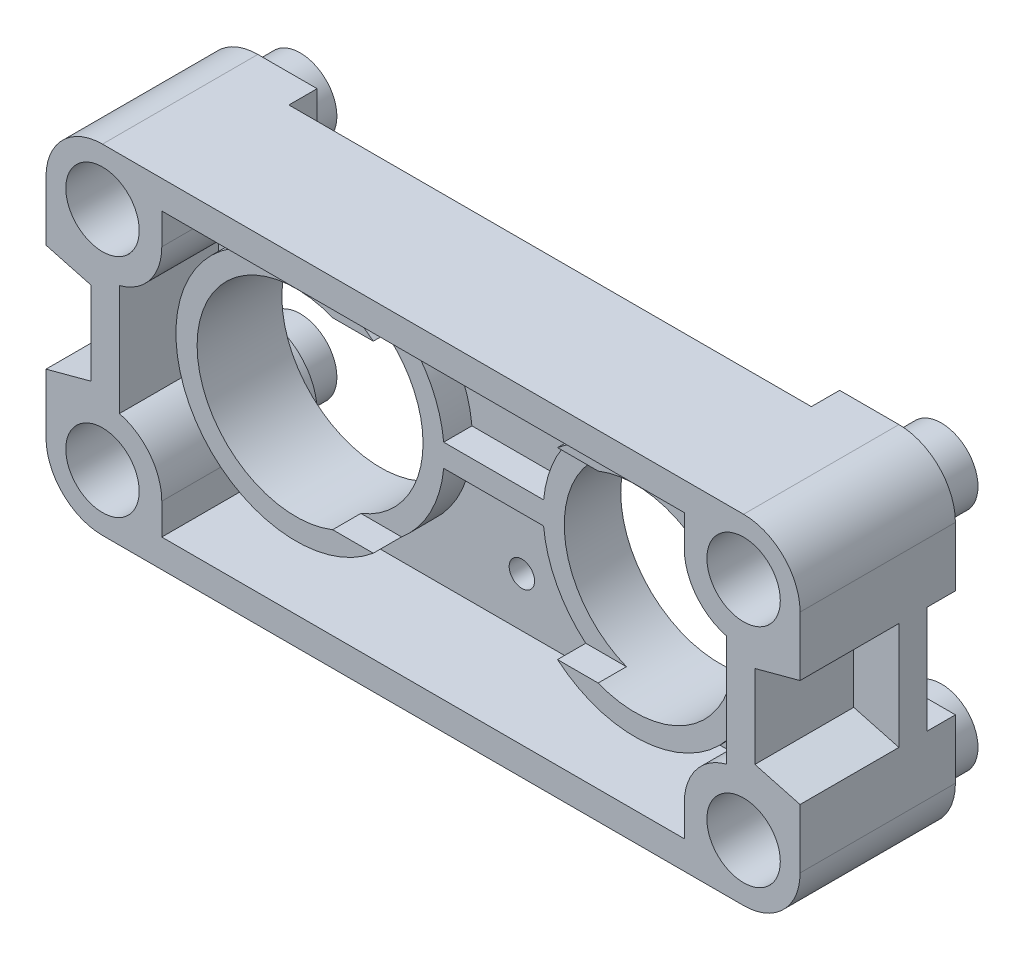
ISO-10303-21;
HEADER;
FILE_DESCRIPTION(('STEP AP214'),'2;1');
FILE_NAME('part.step','',(''),(''),'','','');
FILE_SCHEMA(('AUTOMOTIVE_DESIGN { 1 0 10303 214 1 1 1 1 }'));
ENDSEC;
DATA;
#1=APPLICATION_CONTEXT('core data for automotive mechanical design processes');
#2=APPLICATION_PROTOCOL_DEFINITION('international standard','automotive_design',2000,#1);
#3=PRODUCT_CONTEXT('',#1,'mechanical');
#4=PRODUCT('Part','Part','',(#3));
#5=PRODUCT_RELATED_PRODUCT_CATEGORY('part','',(#4));
#6=PRODUCT_DEFINITION_FORMATION('','',#4);
#7=PRODUCT_DEFINITION_CONTEXT('part definition',#1,'design');
#8=PRODUCT_DEFINITION('design','',#6,#7);
#9=PRODUCT_DEFINITION_SHAPE('','',#8);
#10=(LENGTH_UNIT() NAMED_UNIT(*) SI_UNIT(.MILLI.,.METRE.));
#11=(NAMED_UNIT(*) PLANE_ANGLE_UNIT() SI_UNIT($,.RADIAN.));
#12=(NAMED_UNIT(*) SI_UNIT($,.STERADIAN.) SOLID_ANGLE_UNIT());
#13=UNCERTAINTY_MEASURE_WITH_UNIT(LENGTH_MEASURE(1.E-05),#10,'distance_accuracy_value','');
#14=(GEOMETRIC_REPRESENTATION_CONTEXT(3) GLOBAL_UNCERTAINTY_ASSIGNED_CONTEXT((#13)) GLOBAL_UNIT_ASSIGNED_CONTEXT((#10,
#11,#12)) REPRESENTATION_CONTEXT('',''));
#15=CARTESIAN_POINT('',(0.,0.,0.));
#16=DIRECTION('',(0.,0.,1.));
#17=DIRECTION('',(1.,0.,0.));
#18=AXIS2_PLACEMENT_3D('',#15,#16,#17);
#19=CARTESIAN_POINT('',(-6.,0.,4.));
#20=DIRECTION('',(0.,0.,1.));
#21=DIRECTION('',(1.,0.,0.));
#22=AXIS2_PLACEMENT_3D('',#19,#20,#21);
#23=PLANE('',#22);
#24=DIRECTION('',(-1.,0.,0.));
#25=VECTOR('',#24,1.);
#26=CARTESIAN_POINT('',(-5.4,3.25,4.));
#27=LINE('',#26,#25);
#28=CARTESIAN_POINT('',(4.70096189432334,3.25,4.));
#29=VERTEX_POINT('',#28);
#30=CARTESIAN_POINT('',(3.26138721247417,3.25,4.));
#31=VERTEX_POINT('',#30);
#32=EDGE_CURVE('E940',#29,#31,#27,.T.);
#33=ORIENTED_EDGE('',*,*,#32,.F.);
#34=CARTESIAN_POINT('',(6.,0.,4.));
#35=DIRECTION('',(0.,0.,1.));
#36=DIRECTION('',(1.,0.,0.));
#37=AXIS2_PLACEMENT_3D('',#34,#35,#36);
#38=CIRCLE('',#37,3.5);
#39=CARTESIAN_POINT('',(4.70096189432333,-3.25,4.));
#40=VERTEX_POINT('',#39);
#41=EDGE_CURVE('E499',#40,#29,#38,.T.);
#42=ORIENTED_EDGE('',*,*,#41,.F.);
#43=DIRECTION('',(1.,0.,0.));
#44=VECTOR('',#43,1.);
#45=CARTESIAN_POINT('',(-5.4,-3.25,4.));
#46=LINE('',#45,#44);
#47=CARTESIAN_POINT('',(3.26138721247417,-3.25,4.));
#48=VERTEX_POINT('',#47);
#49=EDGE_CURVE('E494',#48,#40,#46,.T.);
#50=ORIENTED_EDGE('',*,*,#49,.F.);
#51=CARTESIAN_POINT('',(6.,0.,4.));
#52=DIRECTION('',(0.,0.,1.));
#53=DIRECTION('',(1.,0.,0.));
#54=AXIS2_PLACEMENT_3D('',#51,#52,#53);
#55=CIRCLE('',#54,4.25);
#56=EDGE_CURVE('E518',#48,#31,#55,.T.);
#57=ORIENTED_EDGE('',*,*,#56,.T.);
#58=EDGE_LOOP('',(#33,#42,#50,#57));
#59=FACE_BOUND('',#58,.T.);
#60=ADVANCED_FACE('F117',(#59),#23,.T.);
#61=CARTESIAN_POINT('',(-1.768865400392,-0.400000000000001,4.));
#62=DIRECTION('',(0.,1.,0.));
#63=DIRECTION('',(-1.,0.,0.));
#64=AXIS2_PLACEMENT_3D('',#61,#62,#63);
#65=PLANE('',#64);
#66=DIRECTION('',(1.,0.,0.));
#67=VECTOR('',#66,1.);
#68=CARTESIAN_POINT('',(-1.768865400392,-0.400000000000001,3.));
#69=LINE('',#68,#67);
#70=CARTESIAN_POINT('',(-1.768865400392,-0.400000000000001,3.));
#71=VERTEX_POINT('',#70);
#72=CARTESIAN_POINT('',(1.76886540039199,-0.4,3.));
#73=VERTEX_POINT('',#72);
#74=EDGE_CURVE('E950',#71,#73,#69,.T.);
#75=ORIENTED_EDGE('',*,*,#74,.F.);
#76=DIRECTION('',(0.,0.,-1.));
#77=VECTOR('',#76,1.);
#78=CARTESIAN_POINT('',(-1.768865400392,-0.400000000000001,4.));
#79=LINE('',#78,#77);
#80=CARTESIAN_POINT('',(-1.768865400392,-0.400000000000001,2.));
#81=VERTEX_POINT('',#80);
#82=EDGE_CURVE('E526',#71,#81,#79,.T.);
#83=ORIENTED_EDGE('',*,*,#82,.T.);
#84=DIRECTION('',(1.,0.,0.));
#85=VECTOR('',#84,1.);
#86=CARTESIAN_POINT('',(-1.768865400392,-0.400000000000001,2.));
#87=LINE('',#86,#85);
#88=CARTESIAN_POINT('',(1.76886540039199,-0.4,2.));
#89=VERTEX_POINT('',#88);
#90=EDGE_CURVE('E510',#81,#89,#87,.T.);
#91=ORIENTED_EDGE('',*,*,#90,.T.);
#92=DIRECTION('',(0.,0.,-1.));
#93=VECTOR('',#92,1.);
#94=CARTESIAN_POINT('',(1.76886540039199,-0.4,4.));
#95=LINE('',#94,#93);
#96=EDGE_CURVE('E524',#73,#89,#95,.T.);
#97=ORIENTED_EDGE('',*,*,#96,.F.);
#98=EDGE_LOOP('',(#75,#83,#91,#97));
#99=FACE_BOUND('',#98,.T.);
#100=ADVANCED_FACE('F987',(#99),#65,.F.);
#101=CARTESIAN_POINT('',(-1.768865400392,0.399999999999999,4.));
#102=DIRECTION('',(0.,-1.,0.));
#103=DIRECTION('',(0.,0.,-1.));
#104=AXIS2_PLACEMENT_3D('',#101,#102,#103);
#105=PLANE('',#104);
#106=DIRECTION('',(-1.,0.,0.));
#107=VECTOR('',#106,1.);
#108=CARTESIAN_POINT('',(-1.768865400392,0.399999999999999,3.));
#109=LINE('',#108,#107);
#110=CARTESIAN_POINT('',(1.76886540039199,0.399999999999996,3.));
#111=VERTEX_POINT('',#110);
#112=CARTESIAN_POINT('',(-1.768865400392,0.399999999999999,3.));
#113=VERTEX_POINT('',#112);
#114=EDGE_CURVE('E908',#111,#113,#109,.T.);
#115=ORIENTED_EDGE('',*,*,#114,.F.);
#116=DIRECTION('',(0.,0.,-1.));
#117=VECTOR('',#116,1.);
#118=CARTESIAN_POINT('',(1.76886540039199,0.399999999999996,4.));
#119=LINE('',#118,#117);
#120=CARTESIAN_POINT('',(1.76886540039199,0.399999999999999,2.));
#121=VERTEX_POINT('',#120);
#122=EDGE_CURVE('E139',#111,#121,#119,.T.);
#123=ORIENTED_EDGE('',*,*,#122,.T.);
#124=DIRECTION('',(-1.,0.,0.));
#125=VECTOR('',#124,1.);
#126=CARTESIAN_POINT('',(-1.768865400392,0.399999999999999,2.));
#127=LINE('',#126,#125);
#128=CARTESIAN_POINT('',(-1.768865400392,0.399999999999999,2.));
#129=VERTEX_POINT('',#128);
#130=EDGE_CURVE('E515',#121,#129,#127,.T.);
#131=ORIENTED_EDGE('',*,*,#130,.T.);
#132=DIRECTION('',(0.,0.,-1.));
#133=VECTOR('',#132,1.);
#134=CARTESIAN_POINT('',(-1.768865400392,0.399999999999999,4.));
#135=LINE('',#134,#133);
#136=EDGE_CURVE('E521',#113,#129,#135,.T.);
#137=ORIENTED_EDGE('',*,*,#136,.F.);
#138=EDGE_LOOP('',(#115,#123,#131,#137));
#139=FACE_BOUND('',#138,.T.);
#140=ADVANCED_FACE('F976',(#139),#105,.F.);
#141=CARTESIAN_POINT('',(-11.35,4.,2.));
#142=DIRECTION('',(0.,0.,1.));
#143=DIRECTION('',(1.,0.,0.));
#144=AXIS2_PLACEMENT_3D('',#141,#142,#143);
#145=PLANE('',#144);
#146=DIRECTION('',(0.,1.,0.));
#147=VECTOR('',#146,1.);
#148=CARTESIAN_POINT('',(-9.25,4.,2.));
#149=LINE('',#148,#147);
#150=CARTESIAN_POINT('',(-9.25,-4.99999999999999,2.));
#151=VERTEX_POINT('',#150);
#152=CARTESIAN_POINT('',(-9.25,-3.9,2.));
#153=VERTEX_POINT('',#152);
#154=EDGE_CURVE('E878',#151,#153,#149,.T.);
#155=ORIENTED_EDGE('',*,*,#154,.F.);
#156=DIRECTION('',(-1.,0.,0.));
#157=VECTOR('',#156,1.);
#158=CARTESIAN_POINT('',(-11.35,-4.99999999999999,2.));
#159=LINE('',#158,#157);
#160=CARTESIAN_POINT('',(9.25,-4.99999999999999,2.));
#161=VERTEX_POINT('',#160);
#162=EDGE_CURVE('E875',#161,#151,#159,.T.);
#163=ORIENTED_EDGE('',*,*,#162,.F.);
#164=DIRECTION('',(0.,1.,0.));
#165=VECTOR('',#164,1.);
#166=CARTESIAN_POINT('',(9.25,4.,2.));
#167=LINE('',#166,#165);
#168=CARTESIAN_POINT('',(9.25,-3.90000000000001,2.));
#169=VERTEX_POINT('',#168);
#170=EDGE_CURVE('E873',#161,#169,#167,.T.);
#171=ORIENTED_EDGE('',*,*,#170,.T.);
#172=CARTESIAN_POINT('',(11.25,-3.9,2.));
#173=DIRECTION('',(0.,0.,1.));
#174=DIRECTION('',(1.,0.,0.));
#175=AXIS2_PLACEMENT_3D('',#172,#173,#174);
#176=CIRCLE('',#175,2.);
#177=CARTESIAN_POINT('',(10.75,-1.96350832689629,2.));
#178=VERTEX_POINT('',#177);
#179=EDGE_CURVE('E871',#169,#178,#176,.F.);
#180=ORIENTED_EDGE('',*,*,#179,.T.);
#181=DIRECTION('',(0.,1.,0.));
#182=VECTOR('',#181,1.);
#183=CARTESIAN_POINT('',(10.75,4.,2.));
#184=LINE('',#183,#182);
#185=CARTESIAN_POINT('',(10.75,1.96350832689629,2.));
#186=VERTEX_POINT('',#185);
#187=EDGE_CURVE('E869',#178,#186,#184,.T.);
#188=ORIENTED_EDGE('',*,*,#187,.T.);
#189=CARTESIAN_POINT('',(11.25,3.9,2.));
#190=DIRECTION('',(0.,0.,1.));
#191=DIRECTION('',(1.,0.,0.));
#192=AXIS2_PLACEMENT_3D('',#189,#190,#191);
#193=CIRCLE('',#192,2.);
#194=CARTESIAN_POINT('',(9.25,3.90000000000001,2.));
#195=VERTEX_POINT('',#194);
#196=EDGE_CURVE('E866',#195,#186,#193,.T.);
#197=ORIENTED_EDGE('',*,*,#196,.F.);
#198=DIRECTION('',(0.,-1.,0.));
#199=VECTOR('',#198,1.);
#200=CARTESIAN_POINT('',(9.25,4.,2.));
#201=LINE('',#200,#199);
#202=CARTESIAN_POINT('',(9.25,4.99999999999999,2.));
#203=VERTEX_POINT('',#202);
#204=EDGE_CURVE('E863',#203,#195,#201,.T.);
#205=ORIENTED_EDGE('',*,*,#204,.F.);
#206=DIRECTION('',(-1.,0.,0.));
#207=VECTOR('',#206,1.);
#208=CARTESIAN_POINT('',(-11.35,4.99999999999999,2.));
#209=LINE('',#208,#207);
#210=CARTESIAN_POINT('',(-9.25,4.99999999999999,2.));
#211=VERTEX_POINT('',#210);
#212=EDGE_CURVE('E861',#203,#211,#209,.T.);
#213=ORIENTED_EDGE('',*,*,#212,.T.);
#214=DIRECTION('',(0.,-1.,0.));
#215=VECTOR('',#214,1.);
#216=CARTESIAN_POINT('',(-9.25,4.,2.));
#217=LINE('',#216,#215);
#218=CARTESIAN_POINT('',(-9.25,3.9,2.));
#219=VERTEX_POINT('',#218);
#220=EDGE_CURVE('E859',#211,#219,#217,.T.);
#221=ORIENTED_EDGE('',*,*,#220,.T.);
#222=CARTESIAN_POINT('',(-11.25,3.9,2.));
#223=DIRECTION('',(0.,0.,1.));
#224=DIRECTION('',(1.,0.,0.));
#225=AXIS2_PLACEMENT_3D('',#222,#223,#224);
#226=CIRCLE('',#225,2.);
#227=CARTESIAN_POINT('',(-10.75,1.96350832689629,2.));
#228=VERTEX_POINT('',#227);
#229=EDGE_CURVE('E857',#219,#228,#226,.F.);
#230=ORIENTED_EDGE('',*,*,#229,.T.);
#231=DIRECTION('',(0.,1.,0.));
#232=VECTOR('',#231,1.);
#233=CARTESIAN_POINT('',(-10.75,4.,2.));
#234=LINE('',#233,#232);
#235=CARTESIAN_POINT('',(-10.75,-1.96350832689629,2.));
#236=VERTEX_POINT('',#235);
#237=EDGE_CURVE('E853',#236,#228,#234,.T.);
#238=ORIENTED_EDGE('',*,*,#237,.F.);
#239=CARTESIAN_POINT('',(-11.25,-3.9,2.));
#240=DIRECTION('',(0.,0.,1.));
#241=DIRECTION('',(1.,0.,0.));
#242=AXIS2_PLACEMENT_3D('',#239,#240,#241);
#243=CIRCLE('',#242,2.);
#244=EDGE_CURVE('E850',#153,#236,#243,.T.);
#245=ORIENTED_EDGE('',*,*,#244,.F.);
#246=EDGE_LOOP('',(#155,#163,#171,#180,#188,#197,#205,#213,#221,#230,#238,#245));
#247=FACE_BOUND('',#246,.T.);
#248=CARTESIAN_POINT('',(0.,3.25,2.));
#249=DIRECTION('',(0.,0.,1.));
#250=DIRECTION('',(1.,0.,0.));
#251=AXIS2_PLACEMENT_3D('',#248,#249,#250);
#252=CIRCLE('',#251,0.45);
#253=CARTESIAN_POINT('',(0.45,3.25,2.));
#254=VERTEX_POINT('',#253);
#255=EDGE_CURVE('E547',#254,#254,#252,.T.);
#256=ORIENTED_EDGE('',*,*,#255,.F.);
#257=EDGE_LOOP('',(#256));
#258=FACE_BOUND('',#257,.T.);
#259=CARTESIAN_POINT('',(0.,-3.25,2.));
#260=DIRECTION('',(0.,0.,1.));
#261=DIRECTION('',(1.,0.,0.));
#262=AXIS2_PLACEMENT_3D('',#259,#260,#261);
#263=CIRCLE('',#262,0.45);
#264=CARTESIAN_POINT('',(0.45,-3.25,2.));
#265=VERTEX_POINT('',#264);
#266=EDGE_CURVE('E548',#265,#265,#263,.T.);
#267=ORIENTED_EDGE('',*,*,#266,.F.);
#268=EDGE_LOOP('',(#267));
#269=FACE_BOUND('',#268,.T.);
#270=ORIENTED_EDGE('',*,*,#90,.F.);
#271=CARTESIAN_POINT('',(-6.,0.,2.));
#272=DIRECTION('',(0.,0.,1.));
#273=DIRECTION('',(1.,0.,0.));
#274=AXIS2_PLACEMENT_3D('',#271,#272,#273);
#275=CIRCLE('',#274,4.25);
#276=EDGE_CURVE('E502',#129,#81,#275,.T.);
#277=ORIENTED_EDGE('',*,*,#276,.F.);
#278=ORIENTED_EDGE('',*,*,#130,.F.);
#279=CARTESIAN_POINT('',(6.,0.,2.));
#280=DIRECTION('',(0.,0.,1.));
#281=DIRECTION('',(1.,0.,0.));
#282=AXIS2_PLACEMENT_3D('',#279,#280,#281);
#283=CIRCLE('',#282,4.25);
#284=EDGE_CURVE('E513',#89,#121,#283,.T.);
#285=ORIENTED_EDGE('',*,*,#284,.F.);
#286=EDGE_LOOP('',(#270,#277,#278,#285));
#287=FACE_BOUND('',#286,.T.);
#288=ADVANCED_FACE('F974',(#247,#258,#269,#287),#145,.T.);
#289=CARTESIAN_POINT('',(-11.25,-3.9,0.));
#290=DIRECTION('',(0.,0.,1.));
#291=DIRECTION('',(1.,0.,0.));
#292=AXIS2_PLACEMENT_3D('',#289,#290,#291);
#293=PLANE('',#292);
#294=CARTESIAN_POINT('',(-11.25,-3.9,0.));
#295=DIRECTION('',(0.,0.,1.));
#296=DIRECTION('',(1.,0.,0.));
#297=AXIS2_PLACEMENT_3D('',#294,#295,#296);
#298=CIRCLE('',#297,2.);
#299=CARTESIAN_POINT('',(-9.25,-3.90000000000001,0.));
#300=VERTEX_POINT('',#299);
#301=CARTESIAN_POINT('',(-11.25,-1.9,0.));
#302=VERTEX_POINT('',#301);
#303=EDGE_CURVE('E768',#300,#302,#298,.T.);
#304=ORIENTED_EDGE('',*,*,#303,.F.);
#305=DIRECTION('',(0.,1.,0.));
#306=VECTOR('',#305,1.);
#307=CARTESIAN_POINT('',(-9.25,-5.99999999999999,0.));
#308=LINE('',#307,#306);
#309=CARTESIAN_POINT('',(-9.25,-5.99999999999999,0.));
#310=VERTEX_POINT('',#309);
#311=EDGE_CURVE('E781',#310,#300,#308,.T.);
#312=ORIENTED_EDGE('',*,*,#311,.F.);
#313=DIRECTION('',(1.,0.,0.));
#314=VECTOR('',#313,1.);
#315=CARTESIAN_POINT('',(-11.35,-6.,0.));
#316=LINE('',#315,#314);
#317=CARTESIAN_POINT('',(-11.35,-6.,0.));
#318=VERTEX_POINT('',#317);
#319=EDGE_CURVE('E779',#318,#310,#316,.T.);
#320=ORIENTED_EDGE('',*,*,#319,.F.);
#321=CARTESIAN_POINT('',(-11.35,-4.,0.));
#322=DIRECTION('',(0.,0.,1.));
#323=DIRECTION('',(1.,0.,0.));
#324=AXIS2_PLACEMENT_3D('',#321,#322,#323);
#325=CIRCLE('',#324,2.);
#326=CARTESIAN_POINT('',(-13.35,-3.99999999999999,0.));
#327=VERTEX_POINT('',#326);
#328=EDGE_CURVE('E776',#327,#318,#325,.T.);
#329=ORIENTED_EDGE('',*,*,#328,.F.);
#330=DIRECTION('',(0.,-1.,0.));
#331=VECTOR('',#330,1.);
#332=CARTESIAN_POINT('',(-13.35,-1.9,0.));
#333=LINE('',#332,#331);
#334=CARTESIAN_POINT('',(-13.35,-1.9,0.));
#335=VERTEX_POINT('',#334);
#336=EDGE_CURVE('E773',#335,#327,#333,.T.);
#337=ORIENTED_EDGE('',*,*,#336,.F.);
#338=DIRECTION('',(-1.,0.,0.));
#339=VECTOR('',#338,1.);
#340=CARTESIAN_POINT('',(-11.25,-1.9,0.));
#341=LINE('',#340,#339);
#342=EDGE_CURVE('E771',#302,#335,#341,.T.);
#343=ORIENTED_EDGE('',*,*,#342,.F.);
#344=EDGE_LOOP('',(#304,#312,#320,#329,#337,#343));
#345=FACE_BOUND('',#344,.T.);
#346=CARTESIAN_POINT('',(-11.35,-4.,0.));
#347=DIRECTION('',(0.,0.,1.));
#348=DIRECTION('',(1.,0.,0.));
#349=AXIS2_PLACEMENT_3D('',#346,#347,#348);
#350=CIRCLE('',#349,1.3);
#351=CARTESIAN_POINT('',(-10.05,-4.,0.));
#352=VERTEX_POINT('',#351);
#353=EDGE_CURVE('E905',#352,#352,#350,.F.);
#354=ORIENTED_EDGE('',*,*,#353,.F.);
#355=EDGE_LOOP('',(#354));
#356=FACE_BOUND('',#355,.T.);
#357=ADVANCED_FACE('F1188',(#345,#356),#293,.F.);
#358=CARTESIAN_POINT('',(11.35,-4.,0.));
#359=DIRECTION('',(0.,0.,1.));
#360=DIRECTION('',(1.,0.,0.));
#361=AXIS2_PLACEMENT_3D('',#358,#359,#360);
#362=PLANE('',#361);
#363=CARTESIAN_POINT('',(11.35,-4.,0.));
#364=DIRECTION('',(0.,0.,1.));
#365=DIRECTION('',(1.,0.,0.));
#366=AXIS2_PLACEMENT_3D('',#363,#364,#365);
#367=CIRCLE('',#366,2.);
#368=CARTESIAN_POINT('',(11.35,-6.,0.));
#369=VERTEX_POINT('',#368);
#370=CARTESIAN_POINT('',(13.35,-3.99999999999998,0.));
#371=VERTEX_POINT('',#370);
#372=EDGE_CURVE('E1296',#369,#371,#367,.T.);
#373=ORIENTED_EDGE('',*,*,#372,.F.);
#374=DIRECTION('',(1.,0.,0.));
#375=VECTOR('',#374,1.);
#376=CARTESIAN_POINT('',(9.25,-5.99999999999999,0.));
#377=LINE('',#376,#375);
#378=CARTESIAN_POINT('',(9.25,-5.99999999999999,0.));
#379=VERTEX_POINT('',#378);
#380=EDGE_CURVE('E1313',#379,#369,#377,.T.);
#381=ORIENTED_EDGE('',*,*,#380,.F.);
#382=DIRECTION('',(0.,-1.,0.));
#383=VECTOR('',#382,1.);
#384=CARTESIAN_POINT('',(9.25,-3.90000000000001,0.));
#385=LINE('',#384,#383);
#386=CARTESIAN_POINT('',(9.25,-3.90000000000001,0.));
#387=VERTEX_POINT('',#386);
#388=EDGE_CURVE('E1311',#387,#379,#385,.T.);
#389=ORIENTED_EDGE('',*,*,#388,.F.);
#390=CARTESIAN_POINT('',(11.25,-3.9,0.));
#391=DIRECTION('',(0.,0.,1.));
#392=DIRECTION('',(1.,0.,0.));
#393=AXIS2_PLACEMENT_3D('',#390,#391,#392);
#394=CIRCLE('',#393,2.);
#395=CARTESIAN_POINT('',(11.25,-1.9,0.));
#396=VERTEX_POINT('',#395);
#397=EDGE_CURVE('E1309',#396,#387,#394,.T.);
#398=ORIENTED_EDGE('',*,*,#397,.F.);
#399=DIRECTION('',(-1.,0.,0.));
#400=VECTOR('',#399,1.);
#401=CARTESIAN_POINT('',(11.25,-1.9,0.));
#402=LINE('',#401,#400);
#403=CARTESIAN_POINT('',(13.35,-1.9,0.));
#404=VERTEX_POINT('',#403);
#405=EDGE_CURVE('E1298',#404,#396,#402,.T.);
#406=ORIENTED_EDGE('',*,*,#405,.F.);
#407=DIRECTION('',(0.,1.,0.));
#408=VECTOR('',#407,1.);
#409=CARTESIAN_POINT('',(13.35,-3.99999999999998,0.));
#410=LINE('',#409,#408);
#411=EDGE_CURVE('E1287',#371,#404,#410,.T.);
#412=ORIENTED_EDGE('',*,*,#411,.F.);
#413=EDGE_LOOP('',(#373,#381,#389,#398,#406,#412));
#414=FACE_BOUND('',#413,.T.);
#415=CARTESIAN_POINT('',(11.35,-4.,0.));
#416=DIRECTION('',(0.,0.,1.));
#417=DIRECTION('',(1.,0.,0.));
#418=AXIS2_PLACEMENT_3D('',#415,#416,#417);
#419=CIRCLE('',#418,1.3);
#420=CARTESIAN_POINT('',(12.65,-4.,0.));
#421=VERTEX_POINT('',#420);
#422=EDGE_CURVE('E902',#421,#421,#419,.F.);
#423=ORIENTED_EDGE('',*,*,#422,.F.);
#424=EDGE_LOOP('',(#423));
#425=FACE_BOUND('',#424,.T.);
#426=ADVANCED_FACE('F1174',(#414,#425),#362,.F.);
#427=CARTESIAN_POINT('',(-11.25,3.9,0.));
#428=DIRECTION('',(0.,0.,1.));
#429=DIRECTION('',(1.,0.,0.));
#430=AXIS2_PLACEMENT_3D('',#427,#428,#429);
#431=PLANE('',#430);
#432=DIRECTION('',(0.,-1.,0.));
#433=VECTOR('',#432,1.);
#434=CARTESIAN_POINT('',(-13.35,3.99999999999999,0.));
#435=LINE('',#434,#433);
#436=CARTESIAN_POINT('',(-13.35,3.99999999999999,0.));
#437=VERTEX_POINT('',#436);
#438=CARTESIAN_POINT('',(-13.35,1.9,0.));
#439=VERTEX_POINT('',#438);
#440=EDGE_CURVE('E734',#437,#439,#435,.T.);
#441=ORIENTED_EDGE('',*,*,#440,.F.);
#442=CARTESIAN_POINT('',(-11.35,4.,0.));
#443=DIRECTION('',(0.,0.,1.));
#444=DIRECTION('',(1.,0.,0.));
#445=AXIS2_PLACEMENT_3D('',#442,#443,#444);
#446=CIRCLE('',#445,2.);
#447=CARTESIAN_POINT('',(-11.35,6.,0.));
#448=VERTEX_POINT('',#447);
#449=EDGE_CURVE('E746',#448,#437,#446,.T.);
#450=ORIENTED_EDGE('',*,*,#449,.F.);
#451=DIRECTION('',(-1.,0.,0.));
#452=VECTOR('',#451,1.);
#453=CARTESIAN_POINT('',(-9.25,6.,0.));
#454=LINE('',#453,#452);
#455=CARTESIAN_POINT('',(-9.25,6.,0.));
#456=VERTEX_POINT('',#455);
#457=EDGE_CURVE('E743',#456,#448,#454,.T.);
#458=ORIENTED_EDGE('',*,*,#457,.F.);
#459=DIRECTION('',(0.,1.,0.));
#460=VECTOR('',#459,1.);
#461=CARTESIAN_POINT('',(-9.25,3.90000000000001,0.));
#462=LINE('',#461,#460);
#463=CARTESIAN_POINT('',(-9.25,3.90000000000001,0.));
#464=VERTEX_POINT('',#463);
#465=EDGE_CURVE('E741',#464,#456,#462,.T.);
#466=ORIENTED_EDGE('',*,*,#465,.F.);
#467=CARTESIAN_POINT('',(-11.25,3.9,0.));
#468=DIRECTION('',(0.,0.,1.));
#469=DIRECTION('',(1.,0.,0.));
#470=AXIS2_PLACEMENT_3D('',#467,#468,#469);
#471=CIRCLE('',#470,2.);
#472=CARTESIAN_POINT('',(-11.25,1.9,0.));
#473=VERTEX_POINT('',#472);
#474=EDGE_CURVE('E739',#473,#464,#471,.T.);
#475=ORIENTED_EDGE('',*,*,#474,.F.);
#476=DIRECTION('',(1.,0.,0.));
#477=VECTOR('',#476,1.);
#478=CARTESIAN_POINT('',(-11.25,1.9,0.));
#479=LINE('',#478,#477);
#480=EDGE_CURVE('E737',#439,#473,#479,.T.);
#481=ORIENTED_EDGE('',*,*,#480,.F.);
#482=EDGE_LOOP('',(#441,#450,#458,#466,#475,#481));
#483=FACE_BOUND('',#482,.T.);
#484=CARTESIAN_POINT('',(-11.35,4.,0.));
#485=DIRECTION('',(0.,0.,1.));
#486=DIRECTION('',(1.,0.,0.));
#487=AXIS2_PLACEMENT_3D('',#484,#485,#486);
#488=CIRCLE('',#487,1.3);
#489=CARTESIAN_POINT('',(-10.05,4.,0.));
#490=VERTEX_POINT('',#489);
#491=EDGE_CURVE('E899',#490,#490,#488,.F.);
#492=ORIENTED_EDGE('',*,*,#491,.F.);
#493=EDGE_LOOP('',(#492));
#494=FACE_BOUND('',#493,.T.);
#495=ADVANCED_FACE('F1170',(#483,#494),#431,.F.);
#496=CARTESIAN_POINT('',(11.35,4.,0.));
#497=DIRECTION('',(0.,0.,1.));
#498=DIRECTION('',(1.,0.,0.));
#499=AXIS2_PLACEMENT_3D('',#496,#497,#498);
#500=PLANE('',#499);
#501=CARTESIAN_POINT('',(11.35,4.,0.));
#502=DIRECTION('',(0.,0.,1.));
#503=DIRECTION('',(1.,0.,0.));
#504=AXIS2_PLACEMENT_3D('',#501,#502,#503);
#505=CIRCLE('',#504,2.);
#506=CARTESIAN_POINT('',(13.35,3.99999999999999,0.));
#507=VERTEX_POINT('',#506);
#508=CARTESIAN_POINT('',(11.35,6.,0.));
#509=VERTEX_POINT('',#508);
#510=EDGE_CURVE('E802',#507,#509,#505,.T.);
#511=ORIENTED_EDGE('',*,*,#510,.F.);
#512=DIRECTION('',(0.,1.,0.));
#513=VECTOR('',#512,1.);
#514=CARTESIAN_POINT('',(13.35,1.9,0.));
#515=LINE('',#514,#513);
#516=CARTESIAN_POINT('',(13.35,1.9,0.));
#517=VERTEX_POINT('',#516);
#518=EDGE_CURVE('E813',#517,#507,#515,.T.);
#519=ORIENTED_EDGE('',*,*,#518,.F.);
#520=DIRECTION('',(1.,0.,0.));
#521=VECTOR('',#520,1.);
#522=CARTESIAN_POINT('',(11.25,1.9,0.));
#523=LINE('',#522,#521);
#524=CARTESIAN_POINT('',(11.25,1.9,0.));
#525=VERTEX_POINT('',#524);
#526=EDGE_CURVE('E811',#525,#517,#523,.T.);
#527=ORIENTED_EDGE('',*,*,#526,.F.);
#528=CARTESIAN_POINT('',(11.25,3.9,0.));
#529=DIRECTION('',(0.,0.,1.));
#530=DIRECTION('',(1.,0.,0.));
#531=AXIS2_PLACEMENT_3D('',#528,#529,#530);
#532=CIRCLE('',#531,2.);
#533=CARTESIAN_POINT('',(9.25,3.90000000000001,0.));
#534=VERTEX_POINT('',#533);
#535=EDGE_CURVE('E809',#534,#525,#532,.T.);
#536=ORIENTED_EDGE('',*,*,#535,.F.);
#537=DIRECTION('',(0.,-1.,0.));
#538=VECTOR('',#537,1.);
#539=CARTESIAN_POINT('',(9.25,6.,0.));
#540=LINE('',#539,#538);
#541=CARTESIAN_POINT('',(9.25,6.,0.));
#542=VERTEX_POINT('',#541);
#543=EDGE_CURVE('E807',#542,#534,#540,.T.);
#544=ORIENTED_EDGE('',*,*,#543,.F.);
#545=DIRECTION('',(-1.,0.,0.));
#546=VECTOR('',#545,1.);
#547=CARTESIAN_POINT('',(11.35,6.,0.));
#548=LINE('',#547,#546);
#549=EDGE_CURVE('E805',#509,#542,#548,.T.);
#550=ORIENTED_EDGE('',*,*,#549,.F.);
#551=EDGE_LOOP('',(#511,#519,#527,#536,#544,#550));
#552=FACE_BOUND('',#551,.T.);
#553=CARTESIAN_POINT('',(11.35,4.,0.));
#554=DIRECTION('',(0.,0.,1.));
#555=DIRECTION('',(1.,0.,0.));
#556=AXIS2_PLACEMENT_3D('',#553,#554,#555);
#557=CIRCLE('',#556,1.3);
#558=CARTESIAN_POINT('',(12.65,4.,0.));
#559=VERTEX_POINT('',#558);
#560=EDGE_CURVE('E896',#559,#559,#557,.F.);
#561=ORIENTED_EDGE('',*,*,#560,.F.);
#562=EDGE_LOOP('',(#561));
#563=FACE_BOUND('',#562,.T.);
#564=ADVANCED_FACE('F1173',(#552,#563),#500,.F.);
#565=DIRECTION('',(0.965925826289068,-0.258819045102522,0.));
#566=VECTOR('',#565,1.);
#567=CARTESIAN_POINT('',(-12.0089745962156,1.54067332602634,2.));
#568=LINE('',#567,#566);
#569=CARTESIAN_POINT('',(-13.35,1.9,2.));
#570=VERTEX_POINT('',#569);
#571=CARTESIAN_POINT('',(-11.75,1.4712812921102,2.));
#572=VERTEX_POINT('',#571);
#573=EDGE_CURVE('E893',#570,#572,#568,.T.);
#574=ORIENTED_EDGE('',*,*,#573,.F.);
#575=DIRECTION('',(0.,-1.,0.));
#576=VECTOR('',#575,1.);
#577=CARTESIAN_POINT('',(-13.35,3.99999999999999,2.));
#578=LINE('',#577,#576);
#579=CARTESIAN_POINT('',(-13.35,-1.9,2.));
#580=VERTEX_POINT('',#579);
#581=EDGE_CURVE('E841',#570,#580,#578,.T.);
#582=ORIENTED_EDGE('',*,*,#581,.T.);
#583=DIRECTION('',(0.965925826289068,0.258819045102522,0.));
#584=VECTOR('',#583,1.);
#585=CARTESIAN_POINT('',(-10.0089745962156,-1.00477494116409,2.));
#586=LINE('',#585,#584);
#587=CARTESIAN_POINT('',(-11.75,-1.4712812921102,2.));
#588=VERTEX_POINT('',#587);
#589=EDGE_CURVE('E889',#580,#588,#586,.T.);
#590=ORIENTED_EDGE('',*,*,#589,.T.);
#591=DIRECTION('',(0.,1.,0.));
#592=VECTOR('',#591,1.);
#593=CARTESIAN_POINT('',(-11.75,4.,2.));
#594=LINE('',#593,#592);
#595=EDGE_CURVE('E891',#588,#572,#594,.T.);
#596=ORIENTED_EDGE('',*,*,#595,.T.);
#597=EDGE_LOOP('',(#574,#582,#590,#596));
#598=FACE_BOUND('',#597,.T.);
#599=ADVANCED_FACE('F1206',(#598),#145,.T.);
#600=DIRECTION('',(-0.965925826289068,0.258819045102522,0.));
#601=VECTOR('',#600,1.);
#602=CARTESIAN_POINT('',(-11.1704137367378,4.67022505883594,2.));
#603=LINE('',#602,#601);
#604=CARTESIAN_POINT('',(13.35,-1.9,2.));
#605=VERTEX_POINT('',#604);
#606=CARTESIAN_POINT('',(11.75,-1.4712812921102,2.));
#607=VERTEX_POINT('',#606);
#608=EDGE_CURVE('E886',#605,#607,#603,.T.);
#609=ORIENTED_EDGE('',*,*,#608,.F.);
#610=DIRECTION('',(0.,1.,0.));
#611=VECTOR('',#610,1.);
#612=CARTESIAN_POINT('',(13.35,-3.99999999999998,2.));
#613=LINE('',#612,#611);
#614=CARTESIAN_POINT('',(13.35,1.9,2.));
#615=VERTEX_POINT('',#614);
#616=EDGE_CURVE('E1276',#605,#615,#613,.T.);
#617=ORIENTED_EDGE('',*,*,#616,.T.);
#618=DIRECTION('',(-0.965925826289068,-0.258819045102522,0.));
#619=VECTOR('',#618,1.);
#620=CARTESIAN_POINT('',(-9.1704137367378,-4.13432667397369,2.));
#621=LINE('',#620,#619);
#622=CARTESIAN_POINT('',(11.75,1.4712812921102,2.));
#623=VERTEX_POINT('',#622);
#624=EDGE_CURVE('E881',#615,#623,#621,.T.);
#625=ORIENTED_EDGE('',*,*,#624,.T.);
#626=DIRECTION('',(0.,1.,0.));
#627=VECTOR('',#626,1.);
#628=CARTESIAN_POINT('',(11.75,4.,2.));
#629=LINE('',#628,#627);
#630=EDGE_CURVE('E883',#607,#623,#629,.T.);
#631=ORIENTED_EDGE('',*,*,#630,.F.);
#632=EDGE_LOOP('',(#609,#617,#625,#631));
#633=FACE_BOUND('',#632,.T.);
#634=ADVANCED_FACE('F1223',(#633),#145,.T.);
#635=CARTESIAN_POINT('',(-11.35,4.,1.));
#636=DIRECTION('',(0.,0.,1.));
#637=DIRECTION('',(1.,0.,0.));
#638=AXIS2_PLACEMENT_3D('',#635,#636,#637);
#639=PLANE('',#638);
#640=CARTESIAN_POINT('',(0.,-3.25,1.));
#641=DIRECTION('',(0.,0.,1.));
#642=DIRECTION('',(1.,0.,0.));
#643=AXIS2_PLACEMENT_3D('',#640,#641,#642);
#644=CIRCLE('',#643,0.45);
#645=CARTESIAN_POINT('',(0.45,-3.25,1.));
#646=VERTEX_POINT('',#645);
#647=EDGE_CURVE('E544',#646,#646,#644,.T.);
#648=ORIENTED_EDGE('',*,*,#647,.T.);
#649=EDGE_LOOP('',(#648));
#650=FACE_BOUND('',#649,.T.);
#651=CARTESIAN_POINT('',(0.,3.25,1.));
#652=DIRECTION('',(0.,0.,1.));
#653=DIRECTION('',(1.,0.,0.));
#654=AXIS2_PLACEMENT_3D('',#651,#652,#653);
#655=CIRCLE('',#654,0.45);
#656=CARTESIAN_POINT('',(0.45,3.25,1.));
#657=VERTEX_POINT('',#656);
#658=EDGE_CURVE('E549',#657,#657,#655,.T.);
#659=ORIENTED_EDGE('',*,*,#658,.T.);
#660=EDGE_LOOP('',(#659));
#661=FACE_BOUND('',#660,.T.);
#662=CARTESIAN_POINT('',(6.,0.,1.));
#663=DIRECTION('',(0.,0.,1.));
#664=DIRECTION('',(1.,0.,0.));
#665=AXIS2_PLACEMENT_3D('',#662,#663,#664);
#666=CIRCLE('',#665,3.5);
#667=CARTESIAN_POINT('',(9.5,0.,1.));
#668=VERTEX_POINT('',#667);
#669=EDGE_CURVE('E552',#668,#668,#666,.T.);
#670=ORIENTED_EDGE('',*,*,#669,.T.);
#671=EDGE_LOOP('',(#670));
#672=FACE_BOUND('',#671,.T.);
#673=CARTESIAN_POINT('',(-6.,0.,1.));
#674=DIRECTION('',(0.,0.,1.));
#675=DIRECTION('',(1.,0.,0.));
#676=AXIS2_PLACEMENT_3D('',#673,#674,#675);
#677=CIRCLE('',#676,3.5);
#678=CARTESIAN_POINT('',(-2.5,0.,1.));
#679=VERTEX_POINT('',#678);
#680=EDGE_CURVE('E555',#679,#679,#677,.T.);
#681=ORIENTED_EDGE('',*,*,#680,.T.);
#682=EDGE_LOOP('',(#681));
#683=FACE_BOUND('',#682,.T.);
#684=DIRECTION('',(0.,1.,0.));
#685=VECTOR('',#684,1.);
#686=CARTESIAN_POINT('',(-13.35,1.9,1.));
#687=LINE('',#686,#685);
#688=CARTESIAN_POINT('',(-13.35,-1.9,1.));
#689=VERTEX_POINT('',#688);
#690=CARTESIAN_POINT('',(-13.35,1.9,1.));
#691=VERTEX_POINT('',#690);
#692=EDGE_CURVE('E728',#689,#691,#687,.T.);
#693=ORIENTED_EDGE('',*,*,#692,.T.);
#694=DIRECTION('',(1.,0.,0.));
#695=VECTOR('',#694,1.);
#696=CARTESIAN_POINT('',(-11.25,1.9,1.));
#697=LINE('',#696,#695);
#698=CARTESIAN_POINT('',(-11.25,1.9,1.));
#699=VERTEX_POINT('',#698);
#700=EDGE_CURVE('E749',#691,#699,#697,.T.);
#701=ORIENTED_EDGE('',*,*,#700,.T.);
#702=CARTESIAN_POINT('',(-11.25,3.9,1.));
#703=DIRECTION('',(0.,0.,1.));
#704=DIRECTION('',(1.,0.,0.));
#705=AXIS2_PLACEMENT_3D('',#702,#703,#704);
#706=CIRCLE('',#705,2.);
#707=CARTESIAN_POINT('',(-9.25,3.90000000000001,1.));
#708=VERTEX_POINT('',#707);
#709=EDGE_CURVE('E752',#699,#708,#706,.T.);
#710=ORIENTED_EDGE('',*,*,#709,.T.);
#711=DIRECTION('',(0.,1.,0.));
#712=VECTOR('',#711,1.);
#713=CARTESIAN_POINT('',(-9.25,3.90000000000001,1.));
#714=LINE('',#713,#712);
#715=CARTESIAN_POINT('',(-9.25,6.,1.));
#716=VERTEX_POINT('',#715);
#717=EDGE_CURVE('E754',#708,#716,#714,.T.);
#718=ORIENTED_EDGE('',*,*,#717,.T.);
#719=DIRECTION('',(-1.,0.,0.));
#720=VECTOR('',#719,1.);
#721=CARTESIAN_POINT('',(11.35,6.,1.));
#722=LINE('',#721,#720);
#723=CARTESIAN_POINT('',(9.25,6.,1.));
#724=VERTEX_POINT('',#723);
#725=EDGE_CURVE('E835',#724,#716,#722,.T.);
#726=ORIENTED_EDGE('',*,*,#725,.F.);
#727=DIRECTION('',(0.,-1.,0.));
#728=VECTOR('',#727,1.);
#729=CARTESIAN_POINT('',(9.25,6.,1.));
#730=LINE('',#729,#728);
#731=CARTESIAN_POINT('',(9.25,3.90000000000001,1.));
#732=VERTEX_POINT('',#731);
#733=EDGE_CURVE('E816',#724,#732,#730,.T.);
#734=ORIENTED_EDGE('',*,*,#733,.T.);
#735=CARTESIAN_POINT('',(11.25,3.9,1.));
#736=DIRECTION('',(0.,0.,1.));
#737=DIRECTION('',(1.,0.,0.));
#738=AXIS2_PLACEMENT_3D('',#735,#736,#737);
#739=CIRCLE('',#738,2.);
#740=CARTESIAN_POINT('',(11.25,1.9,1.));
#741=VERTEX_POINT('',#740);
#742=EDGE_CURVE('E818',#732,#741,#739,.T.);
#743=ORIENTED_EDGE('',*,*,#742,.T.);
#744=DIRECTION('',(1.,0.,0.));
#745=VECTOR('',#744,1.);
#746=CARTESIAN_POINT('',(11.25,1.9,1.));
#747=LINE('',#746,#745);
#748=CARTESIAN_POINT('',(13.35,1.9,1.));
#749=VERTEX_POINT('',#748);
#750=EDGE_CURVE('E820',#741,#749,#747,.T.);
#751=ORIENTED_EDGE('',*,*,#750,.T.);
#752=DIRECTION('',(0.,-1.,0.));
#753=VECTOR('',#752,1.);
#754=CARTESIAN_POINT('',(13.35,1.9,1.));
#755=LINE('',#754,#753);
#756=CARTESIAN_POINT('',(13.35,-1.9,1.));
#757=VERTEX_POINT('',#756);
#758=EDGE_CURVE('E731',#749,#757,#755,.T.);
#759=ORIENTED_EDGE('',*,*,#758,.T.);
#760=DIRECTION('',(-1.,0.,0.));
#761=VECTOR('',#760,1.);
#762=CARTESIAN_POINT('',(11.25,-1.9,1.));
#763=LINE('',#762,#761);
#764=CARTESIAN_POINT('',(11.25,-1.9,1.));
#765=VERTEX_POINT('',#764);
#766=EDGE_CURVE('E1315',#757,#765,#763,.T.);
#767=ORIENTED_EDGE('',*,*,#766,.T.);
#768=CARTESIAN_POINT('',(11.25,-3.9,1.));
#769=DIRECTION('',(0.,0.,1.));
#770=DIRECTION('',(1.,0.,0.));
#771=AXIS2_PLACEMENT_3D('',#768,#769,#770);
#772=CIRCLE('',#771,2.);
#773=CARTESIAN_POINT('',(9.25,-3.90000000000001,1.));
#774=VERTEX_POINT('',#773);
#775=EDGE_CURVE('E1318',#765,#774,#772,.T.);
#776=ORIENTED_EDGE('',*,*,#775,.T.);
#777=DIRECTION('',(0.,-1.,0.));
#778=VECTOR('',#777,1.);
#779=CARTESIAN_POINT('',(9.25,-3.90000000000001,1.));
#780=LINE('',#779,#778);
#781=CARTESIAN_POINT('',(9.24999999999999,-6.,1.));
#782=VERTEX_POINT('',#781);
#783=EDGE_CURVE('E847',#774,#782,#780,.T.);
#784=ORIENTED_EDGE('',*,*,#783,.T.);
#785=DIRECTION('',(1.,0.,0.));
#786=VECTOR('',#785,1.);
#787=CARTESIAN_POINT('',(-11.35,-6.,1.));
#788=LINE('',#787,#786);
#789=CARTESIAN_POINT('',(-9.25,-5.99999999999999,1.));
#790=VERTEX_POINT('',#789);
#791=EDGE_CURVE('E838',#790,#782,#788,.T.);
#792=ORIENTED_EDGE('',*,*,#791,.F.);
#793=DIRECTION('',(0.,1.,0.));
#794=VECTOR('',#793,1.);
#795=CARTESIAN_POINT('',(-9.25,-5.99999999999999,1.));
#796=LINE('',#795,#794);
#797=CARTESIAN_POINT('',(-9.25,-3.90000000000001,1.));
#798=VERTEX_POINT('',#797);
#799=EDGE_CURVE('E788',#790,#798,#796,.T.);
#800=ORIENTED_EDGE('',*,*,#799,.T.);
#801=CARTESIAN_POINT('',(-11.25,-3.9,1.));
#802=DIRECTION('',(0.,0.,1.));
#803=DIRECTION('',(1.,0.,0.));
#804=AXIS2_PLACEMENT_3D('',#801,#802,#803);
#805=CIRCLE('',#804,2.);
#806=CARTESIAN_POINT('',(-11.25,-1.9,1.));
#807=VERTEX_POINT('',#806);
#808=EDGE_CURVE('E783',#798,#807,#805,.T.);
#809=ORIENTED_EDGE('',*,*,#808,.T.);
#810=DIRECTION('',(-1.,0.,0.));
#811=VECTOR('',#810,1.);
#812=CARTESIAN_POINT('',(-11.25,-1.9,1.));
#813=LINE('',#812,#811);
#814=EDGE_CURVE('E785',#807,#689,#813,.T.);
#815=ORIENTED_EDGE('',*,*,#814,.T.);
#816=EDGE_LOOP('',(#693,#701,#710,#718,#726,#734,#743,#751,#759,#767,#776,#784,#792,#800,#809,#815));
#817=FACE_BOUND('',#816,.T.);
#818=ADVANCED_FACE('F1220',(#650,#661,#672,#683,#817),#639,.F.);
#819=CARTESIAN_POINT('',(11.35,-4.,1.));
#820=DIRECTION('',(0.,0.,-1.));
#821=DIRECTION('',(-1.,0.,0.));
#822=AXIS2_PLACEMENT_3D('',#819,#820,#821);
#823=CYLINDRICAL_SURFACE('',#822,2.);
#824=DIRECTION('',(0.,0.,-1.));
#825=VECTOR('',#824,1.);
#826=CARTESIAN_POINT('',(11.35,-6.,1.));
#827=LINE('',#826,#825);
#828=CARTESIAN_POINT('',(11.35,-6.,5.5));
#829=VERTEX_POINT('',#828);
#830=EDGE_CURVE('E1300',#829,#369,#827,.T.);
#831=ORIENTED_EDGE('',*,*,#830,.T.);
#832=ORIENTED_EDGE('',*,*,#372,.T.);
#833=DIRECTION('',(0.,0.,-1.));
#834=VECTOR('',#833,1.);
#835=CARTESIAN_POINT('',(13.35,-3.99999999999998,1.));
#836=LINE('',#835,#834);
#837=CARTESIAN_POINT('',(13.35,-3.99999999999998,5.5));
#838=VERTEX_POINT('',#837);
#839=EDGE_CURVE('E854',#838,#371,#836,.T.);
#840=ORIENTED_EDGE('',*,*,#839,.F.);
#841=CARTESIAN_POINT('',(11.35,-4.,5.5));
#842=DIRECTION('',(0.,0.,1.));
#843=DIRECTION('',(1.,0.,0.));
#844=AXIS2_PLACEMENT_3D('',#841,#842,#843);
#845=CIRCLE('',#844,2.);
#846=EDGE_CURVE('E685',#829,#838,#845,.T.);
#847=ORIENTED_EDGE('',*,*,#846,.F.);
#848=EDGE_LOOP('',(#831,#832,#840,#847));
#849=FACE_BOUND('',#848,.T.);
#850=ADVANCED_FACE('F119',(#849),#823,.T.);
#851=CARTESIAN_POINT('',(13.35,-3.99999999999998,1.));
#852=DIRECTION('',(-1.,0.,0.));
#853=DIRECTION('',(0.,0.,1.));
#854=AXIS2_PLACEMENT_3D('',#851,#852,#853);
#855=PLANE('',#854);
#856=DIRECTION('',(0.,0.,-1.));
#857=VECTOR('',#856,1.);
#858=CARTESIAN_POINT('',(13.35,1.9,5.5));
#859=LINE('',#858,#857);
#860=CARTESIAN_POINT('',(13.35,1.9,5.5));
#861=VERTEX_POINT('',#860);
#862=EDGE_CURVE('E704',#861,#615,#859,.T.);
#863=ORIENTED_EDGE('',*,*,#862,.T.);
#864=ORIENTED_EDGE('',*,*,#616,.F.);
#865=DIRECTION('',(0.,0.,-1.));
#866=VECTOR('',#865,1.);
#867=CARTESIAN_POINT('',(13.35,-1.9,5.5));
#868=LINE('',#867,#866);
#869=CARTESIAN_POINT('',(13.35,-1.9,5.5));
#870=VERTEX_POINT('',#869);
#871=EDGE_CURVE('E713',#870,#605,#868,.T.);
#872=ORIENTED_EDGE('',*,*,#871,.F.);
#873=DIRECTION('',(0.,1.,0.));
#874=VECTOR('',#873,1.);
#875=CARTESIAN_POINT('',(13.35,-3.99999999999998,5.5));
#876=LINE('',#875,#874);
#877=EDGE_CURVE('E688',#838,#870,#876,.T.);
#878=ORIENTED_EDGE('',*,*,#877,.F.);
#879=ORIENTED_EDGE('',*,*,#839,.T.);
#880=ORIENTED_EDGE('',*,*,#411,.T.);
#881=DIRECTION('',(0.,0.,-1.));
#882=VECTOR('',#881,1.);
#883=CARTESIAN_POINT('',(13.35,-1.9,1.));
#884=LINE('',#883,#882);
#885=EDGE_CURVE('E1290',#757,#404,#884,.T.);
#886=ORIENTED_EDGE('',*,*,#885,.F.);
#887=ORIENTED_EDGE('',*,*,#758,.F.);
#888=DIRECTION('',(0.,0.,-1.));
#889=VECTOR('',#888,1.);
#890=CARTESIAN_POINT('',(13.35,1.9,1.));
#891=LINE('',#890,#889);
#892=EDGE_CURVE('E823',#749,#517,#891,.T.);
#893=ORIENTED_EDGE('',*,*,#892,.T.);
#894=ORIENTED_EDGE('',*,*,#518,.T.);
#895=DIRECTION('',(0.,0.,-1.));
#896=VECTOR('',#895,1.);
#897=CARTESIAN_POINT('',(13.35,3.99999999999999,2.));
#898=LINE('',#897,#896);
#899=CARTESIAN_POINT('',(13.35,3.99999999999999,5.5));
#900=VERTEX_POINT('',#899);
#901=EDGE_CURVE('E1351',#900,#507,#898,.T.);
#902=ORIENTED_EDGE('',*,*,#901,.F.);
#903=DIRECTION('',(0.,1.,0.));
#904=VECTOR('',#903,1.);
#905=CARTESIAN_POINT('',(13.35,1.9,5.5));
#906=LINE('',#905,#904);
#907=EDGE_CURVE('E698',#861,#900,#906,.T.);
#908=ORIENTED_EDGE('',*,*,#907,.F.);
#909=EDGE_LOOP('',(#863,#864,#872,#878,#879,#880,#886,#887,#893,#894,#902,#908));
#910=FACE_BOUND('',#909,.T.);
#911=ADVANCED_FACE('F1264',(#910),#855,.F.);
#912=CARTESIAN_POINT('',(11.25,-1.9,1.));
#913=DIRECTION('',(0.,-1.,0.));
#914=DIRECTION('',(0.,0.,-1.));
#915=AXIS2_PLACEMENT_3D('',#912,#913,#914);
#916=PLANE('',#915);
#917=ORIENTED_EDGE('',*,*,#405,.T.);
#918=DIRECTION('',(0.,0.,-1.));
#919=VECTOR('',#918,1.);
#920=CARTESIAN_POINT('',(11.25,-1.9,1.));
#921=LINE('',#920,#919);
#922=EDGE_CURVE('E1326',#765,#396,#921,.T.);
#923=ORIENTED_EDGE('',*,*,#922,.F.);
#924=ORIENTED_EDGE('',*,*,#766,.F.);
#925=ORIENTED_EDGE('',*,*,#885,.T.);
#926=EDGE_LOOP('',(#917,#923,#924,#925));
#927=FACE_BOUND('',#926,.T.);
#928=ADVANCED_FACE('F1261',(#927),#916,.F.);
#929=CARTESIAN_POINT('',(11.25,-3.9,1.));
#930=DIRECTION('',(0.,0.,-1.));
#931=DIRECTION('',(-1.,0.,0.));
#932=AXIS2_PLACEMENT_3D('',#929,#930,#931);
#933=CYLINDRICAL_SURFACE('',#932,2.);
#934=ORIENTED_EDGE('',*,*,#397,.T.);
#935=DIRECTION('',(0.,0.,-1.));
#936=VECTOR('',#935,1.);
#937=CARTESIAN_POINT('',(9.25,-3.90000000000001,1.));
#938=LINE('',#937,#936);
#939=EDGE_CURVE('E1323',#774,#387,#938,.T.);
#940=ORIENTED_EDGE('',*,*,#939,.F.);
#941=ORIENTED_EDGE('',*,*,#775,.F.);
#942=ORIENTED_EDGE('',*,*,#922,.T.);
#943=EDGE_LOOP('',(#934,#940,#941,#942));
#944=FACE_BOUND('',#943,.T.);
#945=ADVANCED_FACE('F1257',(#944),#933,.T.);
#946=CARTESIAN_POINT('',(9.25,-3.90000000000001,1.));
#947=DIRECTION('',(1.,0.,0.));
#948=DIRECTION('',(0.,0.,-1.));
#949=AXIS2_PLACEMENT_3D('',#946,#947,#948);
#950=PLANE('',#949);
#951=ORIENTED_EDGE('',*,*,#388,.T.);
#952=DIRECTION('',(0.,0.,-1.));
#953=VECTOR('',#952,1.);
#954=CARTESIAN_POINT('',(9.25,-5.99999999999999,1.));
#955=LINE('',#954,#953);
#956=EDGE_CURVE('E1322',#782,#379,#955,.T.);
#957=ORIENTED_EDGE('',*,*,#956,.F.);
#958=ORIENTED_EDGE('',*,*,#783,.F.);
#959=ORIENTED_EDGE('',*,*,#939,.T.);
#960=EDGE_LOOP('',(#951,#957,#958,#959));
#961=FACE_BOUND('',#960,.T.);
#962=ADVANCED_FACE('F1253',(#961),#950,.F.);
#963=CARTESIAN_POINT('',(9.25,-5.99999999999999,1.));
#964=DIRECTION('',(0.,1.,0.));
#965=DIRECTION('',(-1.,0.,0.));
#966=AXIS2_PLACEMENT_3D('',#963,#964,#965);
#967=PLANE('',#966);
#968=DIRECTION('',(0.,0.,-1.));
#969=VECTOR('',#968,1.);
#970=CARTESIAN_POINT('',(-11.35,-6.,2.));
#971=LINE('',#970,#969);
#972=CARTESIAN_POINT('',(-11.35,-6.,5.5));
#973=VERTEX_POINT('',#972);
#974=EDGE_CURVE('E1353',#973,#318,#971,.T.);
#975=ORIENTED_EDGE('',*,*,#974,.T.);
#976=ORIENTED_EDGE('',*,*,#319,.T.);
#977=DIRECTION('',(0.,0.,-1.));
#978=VECTOR('',#977,1.);
#979=CARTESIAN_POINT('',(-9.25,-5.99999999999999,1.));
#980=LINE('',#979,#978);
#981=EDGE_CURVE('E793',#790,#310,#980,.T.);
#982=ORIENTED_EDGE('',*,*,#981,.F.);
#983=ORIENTED_EDGE('',*,*,#791,.T.);
#984=ORIENTED_EDGE('',*,*,#956,.T.);
#985=ORIENTED_EDGE('',*,*,#380,.T.);
#986=ORIENTED_EDGE('',*,*,#830,.F.);
#987=DIRECTION('',(1.,0.,0.));
#988=VECTOR('',#987,1.);
#989=CARTESIAN_POINT('',(-11.35,-6.,5.5));
#990=LINE('',#989,#988);
#991=EDGE_CURVE('E682',#973,#829,#990,.T.);
#992=ORIENTED_EDGE('',*,*,#991,.F.);
#993=EDGE_LOOP('',(#975,#976,#982,#983,#984,#985,#986,#992));
#994=FACE_BOUND('',#993,.T.);
#995=ADVANCED_FACE('F1246',(#994),#967,.F.);
#996=CARTESIAN_POINT('',(11.35,6.,2.));
#997=DIRECTION('',(0.,-1.,0.));
#998=DIRECTION('',(1.,0.,0.));
#999=AXIS2_PLACEMENT_3D('',#996,#997,#998);
#1000=PLANE('',#999);
#1001=DIRECTION('',(0.,0.,-1.));
#1002=VECTOR('',#1001,1.);
#1003=CARTESIAN_POINT('',(11.35,6.,2.));
#1004=LINE('',#1003,#1002);
#1005=CARTESIAN_POINT('',(11.35,6.,5.5));
#1006=VERTEX_POINT('',#1005);
#1007=EDGE_CURVE('E1354',#1006,#509,#1004,.T.);
#1008=ORIENTED_EDGE('',*,*,#1007,.T.);
#1009=ORIENTED_EDGE('',*,*,#549,.T.);
#1010=DIRECTION('',(0.,0.,-1.));
#1011=VECTOR('',#1010,1.);
#1012=CARTESIAN_POINT('',(9.25,6.,1.));
#1013=LINE('',#1012,#1011);
#1014=EDGE_CURVE('E832',#724,#542,#1013,.T.);
#1015=ORIENTED_EDGE('',*,*,#1014,.F.);
#1016=ORIENTED_EDGE('',*,*,#725,.T.);
#1017=DIRECTION('',(0.,0.,-1.));
#1018=VECTOR('',#1017,1.);
#1019=CARTESIAN_POINT('',(-9.25,6.,1.));
#1020=LINE('',#1019,#1018);
#1021=EDGE_CURVE('E756',#716,#456,#1020,.T.);
#1022=ORIENTED_EDGE('',*,*,#1021,.T.);
#1023=ORIENTED_EDGE('',*,*,#457,.T.);
#1024=DIRECTION('',(0.,0.,-1.));
#1025=VECTOR('',#1024,1.);
#1026=CARTESIAN_POINT('',(-11.35,6.,2.));
#1027=LINE('',#1026,#1025);
#1028=CARTESIAN_POINT('',(-11.35,6.,5.5));
#1029=VERTEX_POINT('',#1028);
#1030=EDGE_CURVE('E1302',#1029,#448,#1027,.T.);
#1031=ORIENTED_EDGE('',*,*,#1030,.F.);
#1032=DIRECTION('',(-1.,0.,0.));
#1033=VECTOR('',#1032,1.);
#1034=CARTESIAN_POINT('',(11.35,6.,5.5));
#1035=LINE('',#1034,#1033);
#1036=EDGE_CURVE('E661',#1006,#1029,#1035,.T.);
#1037=ORIENTED_EDGE('',*,*,#1036,.F.);
#1038=EDGE_LOOP('',(#1008,#1009,#1015,#1016,#1022,#1023,#1031,#1037));
#1039=FACE_BOUND('',#1038,.T.);
#1040=ADVANCED_FACE('F1242',(#1039),#1000,.F.);
#1041=CARTESIAN_POINT('',(-11.35,4.,2.));
#1042=DIRECTION('',(0.,0.,-1.));
#1043=DIRECTION('',(-1.,0.,0.));
#1044=AXIS2_PLACEMENT_3D('',#1041,#1042,#1043);
#1045=CYLINDRICAL_SURFACE('',#1044,2.);
#1046=ORIENTED_EDGE('',*,*,#1030,.T.);
#1047=ORIENTED_EDGE('',*,*,#449,.T.);
#1048=DIRECTION('',(0.,0.,-1.));
#1049=VECTOR('',#1048,1.);
#1050=CARTESIAN_POINT('',(-13.35,3.99999999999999,2.));
#1051=LINE('',#1050,#1049);
#1052=CARTESIAN_POINT('',(-13.35,3.99999999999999,5.5));
#1053=VERTEX_POINT('',#1052);
#1054=EDGE_CURVE('E1304',#1053,#437,#1051,.T.);
#1055=ORIENTED_EDGE('',*,*,#1054,.F.);
#1056=CARTESIAN_POINT('',(-11.35,4.,5.5));
#1057=DIRECTION('',(0.,0.,1.));
#1058=DIRECTION('',(1.,0.,0.));
#1059=AXIS2_PLACEMENT_3D('',#1056,#1057,#1058);
#1060=CIRCLE('',#1059,2.);
#1061=EDGE_CURVE('E664',#1029,#1053,#1060,.T.);
#1062=ORIENTED_EDGE('',*,*,#1061,.F.);
#1063=EDGE_LOOP('',(#1046,#1047,#1055,#1062));
#1064=FACE_BOUND('',#1063,.T.);
#1065=ADVANCED_FACE('F1238',(#1064),#1045,.T.);
#1066=CARTESIAN_POINT('',(-13.35,3.99999999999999,2.));
#1067=DIRECTION('',(1.,0.,0.));
#1068=DIRECTION('',(0.,1.,0.));
#1069=AXIS2_PLACEMENT_3D('',#1066,#1067,#1068);
#1070=PLANE('',#1069);
#1071=DIRECTION('',(0.,0.,-1.));
#1072=VECTOR('',#1071,1.);
#1073=CARTESIAN_POINT('',(-13.35,-1.9,5.5));
#1074=LINE('',#1073,#1072);
#1075=CARTESIAN_POINT('',(-13.35,-1.9,5.5));
#1076=VERTEX_POINT('',#1075);
#1077=EDGE_CURVE('E716',#1076,#580,#1074,.T.);
#1078=ORIENTED_EDGE('',*,*,#1077,.T.);
#1079=ORIENTED_EDGE('',*,*,#581,.F.);
#1080=DIRECTION('',(0.,0.,-1.));
#1081=VECTOR('',#1080,1.);
#1082=CARTESIAN_POINT('',(-13.35,1.9,5.5));
#1083=LINE('',#1082,#1081);
#1084=CARTESIAN_POINT('',(-13.35,1.9,5.5));
#1085=VERTEX_POINT('',#1084);
#1086=EDGE_CURVE('E725',#1085,#570,#1083,.T.);
#1087=ORIENTED_EDGE('',*,*,#1086,.F.);
#1088=DIRECTION('',(0.,-1.,0.));
#1089=VECTOR('',#1088,1.);
#1090=CARTESIAN_POINT('',(-13.35,3.99999999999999,5.5));
#1091=LINE('',#1090,#1089);
#1092=EDGE_CURVE('E667',#1053,#1085,#1091,.T.);
#1093=ORIENTED_EDGE('',*,*,#1092,.F.);
#1094=ORIENTED_EDGE('',*,*,#1054,.T.);
#1095=ORIENTED_EDGE('',*,*,#440,.T.);
#1096=DIRECTION('',(0.,0.,-1.));
#1097=VECTOR('',#1096,1.);
#1098=CARTESIAN_POINT('',(-13.35,1.9,1.));
#1099=LINE('',#1098,#1097);
#1100=EDGE_CURVE('E765',#691,#439,#1099,.T.);
#1101=ORIENTED_EDGE('',*,*,#1100,.F.);
#1102=ORIENTED_EDGE('',*,*,#692,.F.);
#1103=DIRECTION('',(0.,0.,-1.));
#1104=VECTOR('',#1103,1.);
#1105=CARTESIAN_POINT('',(-13.35,-1.9,1.));
#1106=LINE('',#1105,#1104);
#1107=EDGE_CURVE('E796',#689,#335,#1106,.T.);
#1108=ORIENTED_EDGE('',*,*,#1107,.T.);
#1109=ORIENTED_EDGE('',*,*,#336,.T.);
#1110=DIRECTION('',(0.,0.,-1.));
#1111=VECTOR('',#1110,1.);
#1112=CARTESIAN_POINT('',(-13.35,-3.99999999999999,2.));
#1113=LINE('',#1112,#1111);
#1114=CARTESIAN_POINT('',(-13.35,-3.99999999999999,5.5));
#1115=VERTEX_POINT('',#1114);
#1116=EDGE_CURVE('E1360',#1115,#327,#1113,.T.);
#1117=ORIENTED_EDGE('',*,*,#1116,.F.);
#1118=DIRECTION('',(0.,-1.,0.));
#1119=VECTOR('',#1118,1.);
#1120=CARTESIAN_POINT('',(-13.35,-1.9,5.5));
#1121=LINE('',#1120,#1119);
#1122=EDGE_CURVE('E676',#1076,#1115,#1121,.T.);
#1123=ORIENTED_EDGE('',*,*,#1122,.F.);
#1124=EDGE_LOOP('',(#1078,#1079,#1087,#1093,#1094,#1095,#1101,#1102,#1108,#1109,#1117,#1123));
#1125=FACE_BOUND('',#1124,.T.);
#1126=ADVANCED_FACE('F1234',(#1125),#1070,.F.);
#1127=CARTESIAN_POINT('',(-11.35,-4.,2.));
#1128=DIRECTION('',(0.,0.,-1.));
#1129=DIRECTION('',(-1.,0.,0.));
#1130=AXIS2_PLACEMENT_3D('',#1127,#1128,#1129);
#1131=CYLINDRICAL_SURFACE('',#1130,2.);
#1132=ORIENTED_EDGE('',*,*,#1116,.T.);
#1133=ORIENTED_EDGE('',*,*,#328,.T.);
#1134=ORIENTED_EDGE('',*,*,#974,.F.);
#1135=CARTESIAN_POINT('',(-11.35,-4.,5.5));
#1136=DIRECTION('',(0.,0.,1.));
#1137=DIRECTION('',(1.,0.,0.));
#1138=AXIS2_PLACEMENT_3D('',#1135,#1136,#1137);
#1139=CIRCLE('',#1138,2.);
#1140=EDGE_CURVE('E679',#1115,#973,#1139,.T.);
#1141=ORIENTED_EDGE('',*,*,#1140,.F.);
#1142=EDGE_LOOP('',(#1132,#1133,#1134,#1141));
#1143=FACE_BOUND('',#1142,.T.);
#1144=ADVANCED_FACE('F1230',(#1143),#1131,.T.);
#1145=CARTESIAN_POINT('',(11.35,4.,2.));
#1146=DIRECTION('',(0.,0.,-1.));
#1147=DIRECTION('',(-1.,0.,0.));
#1148=AXIS2_PLACEMENT_3D('',#1145,#1146,#1147);
#1149=CYLINDRICAL_SURFACE('',#1148,2.);
#1150=ORIENTED_EDGE('',*,*,#901,.T.);
#1151=ORIENTED_EDGE('',*,*,#510,.T.);
#1152=ORIENTED_EDGE('',*,*,#1007,.F.);
#1153=CARTESIAN_POINT('',(11.35,4.,5.5));
#1154=DIRECTION('',(0.,0.,1.));
#1155=DIRECTION('',(1.,0.,0.));
#1156=AXIS2_PLACEMENT_3D('',#1153,#1154,#1155);
#1157=CIRCLE('',#1156,2.);
#1158=EDGE_CURVE('E701',#900,#1006,#1157,.T.);
#1159=ORIENTED_EDGE('',*,*,#1158,.F.);
#1160=EDGE_LOOP('',(#1150,#1151,#1152,#1159));
#1161=FACE_BOUND('',#1160,.T.);
#1162=ADVANCED_FACE('F1218',(#1161),#1149,.T.);
#1163=CARTESIAN_POINT('',(9.25,6.,1.));
#1164=DIRECTION('',(1.,0.,0.));
#1165=DIRECTION('',(0.,0.,-1.));
#1166=AXIS2_PLACEMENT_3D('',#1163,#1164,#1165);
#1167=PLANE('',#1166);
#1168=ORIENTED_EDGE('',*,*,#543,.T.);
#1169=DIRECTION('',(0.,0.,-1.));
#1170=VECTOR('',#1169,1.);
#1171=CARTESIAN_POINT('',(9.25,3.90000000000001,1.));
#1172=LINE('',#1171,#1170);
#1173=EDGE_CURVE('E829',#732,#534,#1172,.T.);
#1174=ORIENTED_EDGE('',*,*,#1173,.F.);
#1175=ORIENTED_EDGE('',*,*,#733,.F.);
#1176=ORIENTED_EDGE('',*,*,#1014,.T.);
#1177=EDGE_LOOP('',(#1168,#1174,#1175,#1176));
#1178=FACE_BOUND('',#1177,.T.);
#1179=ADVANCED_FACE('F1214',(#1178),#1167,.F.);
#1180=CARTESIAN_POINT('',(11.25,3.9,1.));
#1181=DIRECTION('',(0.,0.,-1.));
#1182=DIRECTION('',(-1.,0.,0.));
#1183=AXIS2_PLACEMENT_3D('',#1180,#1181,#1182);
#1184=CYLINDRICAL_SURFACE('',#1183,2.);
#1185=ORIENTED_EDGE('',*,*,#535,.T.);
#1186=DIRECTION('',(0.,0.,-1.));
#1187=VECTOR('',#1186,1.);
#1188=CARTESIAN_POINT('',(11.25,1.9,1.));
#1189=LINE('',#1188,#1187);
#1190=EDGE_CURVE('E826',#741,#525,#1189,.T.);
#1191=ORIENTED_EDGE('',*,*,#1190,.F.);
#1192=ORIENTED_EDGE('',*,*,#742,.F.);
#1193=ORIENTED_EDGE('',*,*,#1173,.T.);
#1194=EDGE_LOOP('',(#1185,#1191,#1192,#1193));
#1195=FACE_BOUND('',#1194,.T.);
#1196=ADVANCED_FACE('F1210',(#1195),#1184,.T.);
#1197=CARTESIAN_POINT('',(11.25,1.9,1.));
#1198=DIRECTION('',(0.,1.,0.));
#1199=DIRECTION('',(-1.,0.,0.));
#1200=AXIS2_PLACEMENT_3D('',#1197,#1198,#1199);
#1201=PLANE('',#1200);
#1202=ORIENTED_EDGE('',*,*,#526,.T.);
#1203=ORIENTED_EDGE('',*,*,#892,.F.);
#1204=ORIENTED_EDGE('',*,*,#750,.F.);
#1205=ORIENTED_EDGE('',*,*,#1190,.T.);
#1206=EDGE_LOOP('',(#1202,#1203,#1204,#1205));
#1207=FACE_BOUND('',#1206,.T.);
#1208=ADVANCED_FACE('F1202',(#1207),#1201,.F.);
#1209=CARTESIAN_POINT('',(-11.25,-3.9,1.));
#1210=DIRECTION('',(0.,0.,-1.));
#1211=DIRECTION('',(-1.,0.,0.));
#1212=AXIS2_PLACEMENT_3D('',#1209,#1210,#1211);
#1213=CYLINDRICAL_SURFACE('',#1212,2.);
#1214=ORIENTED_EDGE('',*,*,#303,.T.);
#1215=DIRECTION('',(0.,0.,-1.));
#1216=VECTOR('',#1215,1.);
#1217=CARTESIAN_POINT('',(-11.25,-1.9,1.));
#1218=LINE('',#1217,#1216);
#1219=EDGE_CURVE('E799',#807,#302,#1218,.T.);
#1220=ORIENTED_EDGE('',*,*,#1219,.F.);
#1221=ORIENTED_EDGE('',*,*,#808,.F.);
#1222=DIRECTION('',(0.,0.,-1.));
#1223=VECTOR('',#1222,1.);
#1224=CARTESIAN_POINT('',(-9.25,-3.90000000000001,1.));
#1225=LINE('',#1224,#1223);
#1226=EDGE_CURVE('E790',#798,#300,#1225,.T.);
#1227=ORIENTED_EDGE('',*,*,#1226,.T.);
#1228=EDGE_LOOP('',(#1214,#1220,#1221,#1227));
#1229=FACE_BOUND('',#1228,.T.);
#1230=ADVANCED_FACE('F1198',(#1229),#1213,.T.);
#1231=CARTESIAN_POINT('',(-11.25,-1.9,1.));
#1232=DIRECTION('',(0.,-1.,0.));
#1233=DIRECTION('',(1.,0.,0.));
#1234=AXIS2_PLACEMENT_3D('',#1231,#1232,#1233);
#1235=PLANE('',#1234);
#1236=ORIENTED_EDGE('',*,*,#342,.T.);
#1237=ORIENTED_EDGE('',*,*,#1107,.F.);
#1238=ORIENTED_EDGE('',*,*,#814,.F.);
#1239=ORIENTED_EDGE('',*,*,#1219,.T.);
#1240=EDGE_LOOP('',(#1236,#1237,#1238,#1239));
#1241=FACE_BOUND('',#1240,.T.);
#1242=ADVANCED_FACE('F1194',(#1241),#1235,.F.);
#1243=CARTESIAN_POINT('',(-9.25,-5.99999999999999,1.));
#1244=DIRECTION('',(-1.,0.,0.));
#1245=DIRECTION('',(0.,0.,1.));
#1246=AXIS2_PLACEMENT_3D('',#1243,#1244,#1245);
#1247=PLANE('',#1246);
#1248=ORIENTED_EDGE('',*,*,#311,.T.);
#1249=ORIENTED_EDGE('',*,*,#1226,.F.);
#1250=ORIENTED_EDGE('',*,*,#799,.F.);
#1251=ORIENTED_EDGE('',*,*,#981,.T.);
#1252=EDGE_LOOP('',(#1248,#1249,#1250,#1251));
#1253=FACE_BOUND('',#1252,.T.);
#1254=ADVANCED_FACE('F1186',(#1253),#1247,.F.);
#1255=CARTESIAN_POINT('',(-11.25,1.9,1.));
#1256=DIRECTION('',(0.,1.,0.));
#1257=DIRECTION('',(0.,0.,1.));
#1258=AXIS2_PLACEMENT_3D('',#1255,#1256,#1257);
#1259=PLANE('',#1258);
#1260=ORIENTED_EDGE('',*,*,#480,.T.);
#1261=DIRECTION('',(0.,0.,-1.));
#1262=VECTOR('',#1261,1.);
#1263=CARTESIAN_POINT('',(-11.25,1.9,1.));
#1264=LINE('',#1263,#1262);
#1265=EDGE_CURVE('E762',#699,#473,#1264,.T.);
#1266=ORIENTED_EDGE('',*,*,#1265,.F.);
#1267=ORIENTED_EDGE('',*,*,#700,.F.);
#1268=ORIENTED_EDGE('',*,*,#1100,.T.);
#1269=EDGE_LOOP('',(#1260,#1266,#1267,#1268));
#1270=FACE_BOUND('',#1269,.T.);
#1271=ADVANCED_FACE('F1182',(#1270),#1259,.F.);
#1272=CARTESIAN_POINT('',(-11.25,3.9,1.));
#1273=DIRECTION('',(0.,0.,-1.));
#1274=DIRECTION('',(-1.,0.,0.));
#1275=AXIS2_PLACEMENT_3D('',#1272,#1273,#1274);
#1276=CYLINDRICAL_SURFACE('',#1275,2.);
#1277=ORIENTED_EDGE('',*,*,#474,.T.);
#1278=DIRECTION('',(0.,0.,-1.));
#1279=VECTOR('',#1278,1.);
#1280=CARTESIAN_POINT('',(-9.25,3.90000000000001,1.));
#1281=LINE('',#1280,#1279);
#1282=EDGE_CURVE('E759',#708,#464,#1281,.T.);
#1283=ORIENTED_EDGE('',*,*,#1282,.F.);
#1284=ORIENTED_EDGE('',*,*,#709,.F.);
#1285=ORIENTED_EDGE('',*,*,#1265,.T.);
#1286=EDGE_LOOP('',(#1277,#1283,#1284,#1285));
#1287=FACE_BOUND('',#1286,.T.);
#1288=ADVANCED_FACE('F1178',(#1287),#1276,.T.);
#1289=CARTESIAN_POINT('',(-9.25,3.90000000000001,1.));
#1290=DIRECTION('',(-1.,0.,0.));
#1291=DIRECTION('',(0.,0.,1.));
#1292=AXIS2_PLACEMENT_3D('',#1289,#1290,#1291);
#1293=PLANE('',#1292);
#1294=ORIENTED_EDGE('',*,*,#465,.T.);
#1295=ORIENTED_EDGE('',*,*,#1021,.F.);
#1296=ORIENTED_EDGE('',*,*,#717,.F.);
#1297=ORIENTED_EDGE('',*,*,#1282,.T.);
#1298=EDGE_LOOP('',(#1294,#1295,#1296,#1297));
#1299=FACE_BOUND('',#1298,.T.);
#1300=ADVANCED_FACE('F1146',(#1299),#1293,.F.);
#1301=CARTESIAN_POINT('',(-11.35,4.,5.5));
#1302=DIRECTION('',(0.,0.,1.));
#1303=DIRECTION('',(1.,0.,0.));
#1304=AXIS2_PLACEMENT_3D('',#1301,#1302,#1303);
#1305=PLANE('',#1304);
#1306=CARTESIAN_POINT('',(-11.35,4.,5.5));
#1307=DIRECTION('',(0.,0.,1.));
#1308=DIRECTION('',(1.,0.,0.));
#1309=AXIS2_PLACEMENT_3D('',#1306,#1307,#1308);
#1310=CIRCLE('',#1309,1.3);
#1311=CARTESIAN_POINT('',(-10.05,4.,5.5));
#1312=VERTEX_POINT('',#1311);
#1313=EDGE_CURVE('E558',#1312,#1312,#1310,.T.);
#1314=ORIENTED_EDGE('',*,*,#1313,.F.);
#1315=EDGE_LOOP('',(#1314));
#1316=FACE_BOUND('',#1315,.T.);
#1317=CARTESIAN_POINT('',(-11.35,-4.,5.5));
#1318=DIRECTION('',(0.,0.,1.));
#1319=DIRECTION('',(1.,0.,0.));
#1320=AXIS2_PLACEMENT_3D('',#1317,#1318,#1319);
#1321=CIRCLE('',#1320,1.3);
#1322=CARTESIAN_POINT('',(-10.05,-4.,5.5));
#1323=VERTEX_POINT('',#1322);
#1324=EDGE_CURVE('E564',#1323,#1323,#1321,.T.);
#1325=ORIENTED_EDGE('',*,*,#1324,.F.);
#1326=EDGE_LOOP('',(#1325));
#1327=FACE_BOUND('',#1326,.T.);
#1328=CARTESIAN_POINT('',(11.35,-4.,5.5));
#1329=DIRECTION('',(0.,0.,1.));
#1330=DIRECTION('',(1.,0.,0.));
#1331=AXIS2_PLACEMENT_3D('',#1328,#1329,#1330);
#1332=CIRCLE('',#1331,1.3);
#1333=CARTESIAN_POINT('',(12.65,-4.,5.5));
#1334=VERTEX_POINT('',#1333);
#1335=EDGE_CURVE('E570',#1334,#1334,#1332,.T.);
#1336=ORIENTED_EDGE('',*,*,#1335,.F.);
#1337=EDGE_LOOP('',(#1336));
#1338=FACE_BOUND('',#1337,.T.);
#1339=CARTESIAN_POINT('',(11.35,4.,5.5));
#1340=DIRECTION('',(0.,0.,1.));
#1341=DIRECTION('',(1.,0.,0.));
#1342=AXIS2_PLACEMENT_3D('',#1339,#1340,#1341);
#1343=CIRCLE('',#1342,1.3);
#1344=CARTESIAN_POINT('',(12.65,4.,5.5));
#1345=VERTEX_POINT('',#1344);
#1346=EDGE_CURVE('E576',#1345,#1345,#1343,.T.);
#1347=ORIENTED_EDGE('',*,*,#1346,.F.);
#1348=EDGE_LOOP('',(#1347));
#1349=FACE_BOUND('',#1348,.T.);
#1350=ORIENTED_EDGE('',*,*,#1036,.T.);
#1351=ORIENTED_EDGE('',*,*,#1061,.T.);
#1352=ORIENTED_EDGE('',*,*,#1092,.T.);
#1353=DIRECTION('',(-0.965925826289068,0.258819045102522,0.));
#1354=VECTOR('',#1353,1.);
#1355=CARTESIAN_POINT('',(-11.75,1.4712812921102,5.5));
#1356=LINE('',#1355,#1354);
#1357=CARTESIAN_POINT('',(-11.75,1.4712812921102,5.5));
#1358=VERTEX_POINT('',#1357);
#1359=EDGE_CURVE('E669',#1358,#1085,#1356,.T.);
#1360=ORIENTED_EDGE('',*,*,#1359,.F.);
#1361=DIRECTION('',(0.,-1.,0.));
#1362=VECTOR('',#1361,1.);
#1363=CARTESIAN_POINT('',(-11.75,1.4712812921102,5.5));
#1364=LINE('',#1363,#1362);
#1365=CARTESIAN_POINT('',(-11.75,-1.4712812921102,5.5));
#1366=VERTEX_POINT('',#1365);
#1367=EDGE_CURVE('E672',#1358,#1366,#1364,.T.);
#1368=ORIENTED_EDGE('',*,*,#1367,.T.);
#1369=DIRECTION('',(-0.965925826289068,-0.258819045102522,0.));
#1370=VECTOR('',#1369,1.);
#1371=CARTESIAN_POINT('',(-11.75,-1.4712812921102,5.5));
#1372=LINE('',#1371,#1370);
#1373=EDGE_CURVE('E674',#1366,#1076,#1372,.T.);
#1374=ORIENTED_EDGE('',*,*,#1373,.T.);
#1375=ORIENTED_EDGE('',*,*,#1122,.T.);
#1376=ORIENTED_EDGE('',*,*,#1140,.T.);
#1377=ORIENTED_EDGE('',*,*,#991,.T.);
#1378=ORIENTED_EDGE('',*,*,#846,.T.);
#1379=ORIENTED_EDGE('',*,*,#877,.T.);
#1380=DIRECTION('',(0.965925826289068,-0.258819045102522,0.));
#1381=VECTOR('',#1380,1.);
#1382=CARTESIAN_POINT('',(11.75,-1.4712812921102,5.5));
#1383=LINE('',#1382,#1381);
#1384=CARTESIAN_POINT('',(11.75,-1.4712812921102,5.5));
#1385=VERTEX_POINT('',#1384);
#1386=EDGE_CURVE('E690',#1385,#870,#1383,.T.);
#1387=ORIENTED_EDGE('',*,*,#1386,.F.);
#1388=DIRECTION('',(0.,-1.,0.));
#1389=VECTOR('',#1388,1.);
#1390=CARTESIAN_POINT('',(11.75,1.4712812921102,5.5));
#1391=LINE('',#1390,#1389);
#1392=CARTESIAN_POINT('',(11.75,1.4712812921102,5.5));
#1393=VERTEX_POINT('',#1392);
#1394=EDGE_CURVE('E693',#1393,#1385,#1391,.T.);
#1395=ORIENTED_EDGE('',*,*,#1394,.F.);
#1396=DIRECTION('',(0.965925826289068,0.258819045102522,0.));
#1397=VECTOR('',#1396,1.);
#1398=CARTESIAN_POINT('',(11.75,1.4712812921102,5.5));
#1399=LINE('',#1398,#1397);
#1400=EDGE_CURVE('E696',#1393,#861,#1399,.T.);
#1401=ORIENTED_EDGE('',*,*,#1400,.T.);
#1402=ORIENTED_EDGE('',*,*,#907,.T.);
#1403=ORIENTED_EDGE('',*,*,#1158,.T.);
#1404=EDGE_LOOP('',(#1350,#1351,#1352,#1360,#1368,#1374,#1375,#1376,#1377,#1378,#1379,#1387,
#1395,#1401,#1402,#1403));
#1405=FACE_BOUND('',#1404,.T.);
#1406=DIRECTION('',(1.,0.,0.));
#1407=VECTOR('',#1406,1.);
#1408=CARTESIAN_POINT('',(-9.25,-4.99999999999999,5.5));
#1409=LINE('',#1408,#1407);
#1410=CARTESIAN_POINT('',(-9.25,-4.99999999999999,5.5));
#1411=VERTEX_POINT('',#1410);
#1412=CARTESIAN_POINT('',(9.25,-4.99999999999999,5.5));
#1413=VERTEX_POINT('',#1412);
#1414=EDGE_CURVE('E596',#1411,#1413,#1409,.T.);
#1415=ORIENTED_EDGE('',*,*,#1414,.F.);
#1416=DIRECTION('',(0.,-1.,0.));
#1417=VECTOR('',#1416,1.);
#1418=CARTESIAN_POINT('',(-9.25,-3.90000000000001,5.5));
#1419=LINE('',#1418,#1417);
#1420=CARTESIAN_POINT('',(-9.25,-3.90000000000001,5.5));
#1421=VERTEX_POINT('',#1420);
#1422=EDGE_CURVE('E594',#1421,#1411,#1419,.T.);
#1423=ORIENTED_EDGE('',*,*,#1422,.F.);
#1424=CARTESIAN_POINT('',(-11.25,-3.9,5.5));
#1425=DIRECTION('',(0.,0.,-1.));
#1426=DIRECTION('',(-1.,0.,0.));
#1427=AXIS2_PLACEMENT_3D('',#1424,#1425,#1426);
#1428=CIRCLE('',#1427,2.);
#1429=CARTESIAN_POINT('',(-10.75,-1.96350832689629,5.5));
#1430=VERTEX_POINT('',#1429);
#1431=EDGE_CURVE('E623',#1430,#1421,#1428,.T.);
#1432=ORIENTED_EDGE('',*,*,#1431,.F.);
#1433=DIRECTION('',(0.,-1.,0.));
#1434=VECTOR('',#1433,1.);
#1435=CARTESIAN_POINT('',(-10.75,1.96350832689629,5.5));
#1436=LINE('',#1435,#1434);
#1437=CARTESIAN_POINT('',(-10.75,1.96350832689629,5.5));
#1438=VERTEX_POINT('',#1437);
#1439=EDGE_CURVE('E620',#1438,#1430,#1436,.T.);
#1440=ORIENTED_EDGE('',*,*,#1439,.F.);
#1441=CARTESIAN_POINT('',(-11.25,3.9,5.5));
#1442=DIRECTION('',(0.,0.,1.));
#1443=DIRECTION('',(1.,0.,0.));
#1444=AXIS2_PLACEMENT_3D('',#1441,#1442,#1443);
#1445=CIRCLE('',#1444,2.);
#1446=CARTESIAN_POINT('',(-9.25,3.90000000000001,5.5));
#1447=VERTEX_POINT('',#1446);
#1448=EDGE_CURVE('E617',#1438,#1447,#1445,.T.);
#1449=ORIENTED_EDGE('',*,*,#1448,.T.);
#1450=DIRECTION('',(0.,1.,0.));
#1451=VECTOR('',#1450,1.);
#1452=CARTESIAN_POINT('',(-9.25,3.90000000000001,5.5));
#1453=LINE('',#1452,#1451);
#1454=CARTESIAN_POINT('',(-9.25,4.99999999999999,5.5));
#1455=VERTEX_POINT('',#1454);
#1456=EDGE_CURVE('E614',#1447,#1455,#1453,.T.);
#1457=ORIENTED_EDGE('',*,*,#1456,.T.);
#1458=DIRECTION('',(1.,0.,0.));
#1459=VECTOR('',#1458,1.);
#1460=CARTESIAN_POINT('',(-9.25,4.99999999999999,5.5));
#1461=LINE('',#1460,#1459);
#1462=CARTESIAN_POINT('',(9.25,4.99999999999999,5.5));
#1463=VERTEX_POINT('',#1462);
#1464=EDGE_CURVE('E611',#1455,#1463,#1461,.T.);
#1465=ORIENTED_EDGE('',*,*,#1464,.T.);
#1466=DIRECTION('',(0.,1.,0.));
#1467=VECTOR('',#1466,1.);
#1468=CARTESIAN_POINT('',(9.25,3.90000000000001,5.5));
#1469=LINE('',#1468,#1467);
#1470=CARTESIAN_POINT('',(9.25,3.90000000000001,5.5));
#1471=VERTEX_POINT('',#1470);
#1472=EDGE_CURVE('E609',#1471,#1463,#1469,.T.);
#1473=ORIENTED_EDGE('',*,*,#1472,.F.);
#1474=CARTESIAN_POINT('',(11.25,3.9,5.5));
#1475=DIRECTION('',(0.,0.,-1.));
#1476=DIRECTION('',(-1.,0.,0.));
#1477=AXIS2_PLACEMENT_3D('',#1474,#1475,#1476);
#1478=CIRCLE('',#1477,2.);
#1479=CARTESIAN_POINT('',(10.75,1.96350832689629,5.5));
#1480=VERTEX_POINT('',#1479);
#1481=EDGE_CURVE('E607',#1480,#1471,#1478,.T.);
#1482=ORIENTED_EDGE('',*,*,#1481,.F.);
#1483=DIRECTION('',(0.,-1.,0.));
#1484=VECTOR('',#1483,1.);
#1485=CARTESIAN_POINT('',(10.75,1.96350832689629,5.5));
#1486=LINE('',#1485,#1484);
#1487=CARTESIAN_POINT('',(10.75,-1.96350832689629,5.5));
#1488=VERTEX_POINT('',#1487);
#1489=EDGE_CURVE('E604',#1480,#1488,#1486,.T.);
#1490=ORIENTED_EDGE('',*,*,#1489,.T.);
#1491=CARTESIAN_POINT('',(11.25,-3.9,5.5));
#1492=DIRECTION('',(0.,0.,1.));
#1493=DIRECTION('',(1.,0.,0.));
#1494=AXIS2_PLACEMENT_3D('',#1491,#1492,#1493);
#1495=CIRCLE('',#1494,2.);
#1496=CARTESIAN_POINT('',(9.25,-3.90000000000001,5.5));
#1497=VERTEX_POINT('',#1496);
#1498=EDGE_CURVE('E601',#1488,#1497,#1495,.T.);
#1499=ORIENTED_EDGE('',*,*,#1498,.T.);
#1500=DIRECTION('',(0.,-1.,0.));
#1501=VECTOR('',#1500,1.);
#1502=CARTESIAN_POINT('',(9.25,-3.90000000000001,5.5));
#1503=LINE('',#1502,#1501);
#1504=EDGE_CURVE('E598',#1497,#1413,#1503,.T.);
#1505=ORIENTED_EDGE('',*,*,#1504,.T.);
#1506=EDGE_LOOP('',(#1415,#1423,#1432,#1440,#1449,#1457,#1465,#1473,#1482,#1490,#1499,#1505));
#1507=FACE_BOUND('',#1506,.T.);
#1508=ADVANCED_FACE('F1142',(#1316,#1327,#1338,#1349,#1405,#1507),#1305,.T.);
#1509=CARTESIAN_POINT('',(-11.75,1.4712812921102,5.5));
#1510=DIRECTION('',(-0.258819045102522,-0.965925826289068,0.));
#1511=DIRECTION('',(0.965925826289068,-0.258819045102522,0.));
#1512=AXIS2_PLACEMENT_3D('',#1509,#1510,#1511);
#1513=PLANE('',#1512);
#1514=ORIENTED_EDGE('',*,*,#1086,.T.);
#1515=ORIENTED_EDGE('',*,*,#573,.T.);
#1516=DIRECTION('',(0.,0.,-1.));
#1517=VECTOR('',#1516,1.);
#1518=CARTESIAN_POINT('',(-11.75,1.4712812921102,5.5));
#1519=LINE('',#1518,#1517);
#1520=EDGE_CURVE('E722',#1358,#572,#1519,.T.);
#1521=ORIENTED_EDGE('',*,*,#1520,.F.);
#1522=ORIENTED_EDGE('',*,*,#1359,.T.);
#1523=EDGE_LOOP('',(#1514,#1515,#1521,#1522));
#1524=FACE_BOUND('',#1523,.T.);
#1525=ADVANCED_FACE('F1145',(#1524),#1513,.T.);
#1526=CARTESIAN_POINT('',(-11.75,1.4712812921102,5.5));
#1527=DIRECTION('',(1.,0.,0.));
#1528=DIRECTION('',(0.,0.,-1.));
#1529=AXIS2_PLACEMENT_3D('',#1526,#1527,#1528);
#1530=PLANE('',#1529);
#1531=ORIENTED_EDGE('',*,*,#595,.F.);
#1532=DIRECTION('',(0.,0.,-1.));
#1533=VECTOR('',#1532,1.);
#1534=CARTESIAN_POINT('',(-11.75,-1.4712812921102,5.5));
#1535=LINE('',#1534,#1533);
#1536=EDGE_CURVE('E719',#1366,#588,#1535,.T.);
#1537=ORIENTED_EDGE('',*,*,#1536,.F.);
#1538=ORIENTED_EDGE('',*,*,#1367,.F.);
#1539=ORIENTED_EDGE('',*,*,#1520,.T.);
#1540=EDGE_LOOP('',(#1531,#1537,#1538,#1539));
#1541=FACE_BOUND('',#1540,.T.);
#1542=ADVANCED_FACE('F1162',(#1541),#1530,.F.);
#1543=CARTESIAN_POINT('',(-11.75,-1.4712812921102,5.5));
#1544=DIRECTION('',(0.258819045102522,-0.965925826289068,0.));
#1545=DIRECTION('',(0.965925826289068,0.258819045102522,0.));
#1546=AXIS2_PLACEMENT_3D('',#1543,#1544,#1545);
#1547=PLANE('',#1546);
#1548=ORIENTED_EDGE('',*,*,#589,.F.);
#1549=ORIENTED_EDGE('',*,*,#1077,.F.);
#1550=ORIENTED_EDGE('',*,*,#1373,.F.);
#1551=ORIENTED_EDGE('',*,*,#1536,.T.);
#1552=EDGE_LOOP('',(#1548,#1549,#1550,#1551));
#1553=FACE_BOUND('',#1552,.T.);
#1554=ADVANCED_FACE('F1158',(#1553),#1547,.F.);
#1555=CARTESIAN_POINT('',(11.75,-1.4712812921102,5.5));
#1556=DIRECTION('',(0.258819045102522,0.965925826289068,0.));
#1557=DIRECTION('',(-0.965925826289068,0.258819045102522,0.));
#1558=AXIS2_PLACEMENT_3D('',#1555,#1556,#1557);
#1559=PLANE('',#1558);
#1560=ORIENTED_EDGE('',*,*,#871,.T.);
#1561=ORIENTED_EDGE('',*,*,#608,.T.);
#1562=DIRECTION('',(0.,0.,-1.));
#1563=VECTOR('',#1562,1.);
#1564=CARTESIAN_POINT('',(11.75,-1.4712812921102,5.5));
#1565=LINE('',#1564,#1563);
#1566=EDGE_CURVE('E710',#1385,#607,#1565,.T.);
#1567=ORIENTED_EDGE('',*,*,#1566,.F.);
#1568=ORIENTED_EDGE('',*,*,#1386,.T.);
#1569=EDGE_LOOP('',(#1560,#1561,#1567,#1568));
#1570=FACE_BOUND('',#1569,.T.);
#1571=ADVANCED_FACE('F1154',(#1570),#1559,.T.);
#1572=CARTESIAN_POINT('',(11.75,1.4712812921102,5.5));
#1573=DIRECTION('',(1.,0.,0.));
#1574=DIRECTION('',(0.,0.,-1.));
#1575=AXIS2_PLACEMENT_3D('',#1572,#1573,#1574);
#1576=PLANE('',#1575);
#1577=ORIENTED_EDGE('',*,*,#1566,.T.);
#1578=ORIENTED_EDGE('',*,*,#630,.T.);
#1579=DIRECTION('',(0.,0.,-1.));
#1580=VECTOR('',#1579,1.);
#1581=CARTESIAN_POINT('',(11.75,1.4712812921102,5.5));
#1582=LINE('',#1581,#1580);
#1583=EDGE_CURVE('E707',#1393,#623,#1582,.T.);
#1584=ORIENTED_EDGE('',*,*,#1583,.F.);
#1585=ORIENTED_EDGE('',*,*,#1394,.T.);
#1586=EDGE_LOOP('',(#1577,#1578,#1584,#1585));
#1587=FACE_BOUND('',#1586,.T.);
#1588=ADVANCED_FACE('F1150',(#1587),#1576,.T.);
#1589=CARTESIAN_POINT('',(11.75,1.4712812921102,5.5));
#1590=DIRECTION('',(-0.258819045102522,0.965925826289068,0.));
#1591=DIRECTION('',(-0.965925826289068,-0.258819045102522,0.));
#1592=AXIS2_PLACEMENT_3D('',#1589,#1590,#1591);
#1593=PLANE('',#1592);
#1594=ORIENTED_EDGE('',*,*,#624,.F.);
#1595=ORIENTED_EDGE('',*,*,#862,.F.);
#1596=ORIENTED_EDGE('',*,*,#1400,.F.);
#1597=ORIENTED_EDGE('',*,*,#1583,.T.);
#1598=EDGE_LOOP('',(#1594,#1595,#1596,#1597));
#1599=FACE_BOUND('',#1598,.T.);
#1600=ADVANCED_FACE('F1140',(#1599),#1593,.F.);
#1601=CARTESIAN_POINT('',(-9.25,-3.90000000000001,5.5));
#1602=DIRECTION('',(1.,0.,0.));
#1603=DIRECTION('',(0.,0.,-1.));
#1604=AXIS2_PLACEMENT_3D('',#1601,#1602,#1603);
#1605=PLANE('',#1604);
#1606=DIRECTION('',(0.,0.,-1.));
#1607=VECTOR('',#1606,1.);
#1608=CARTESIAN_POINT('',(-9.25,-4.99999999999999,5.5));
#1609=LINE('',#1608,#1607);
#1610=EDGE_CURVE('E658',#1411,#151,#1609,.T.);
#1611=ORIENTED_EDGE('',*,*,#1610,.T.);
#1612=ORIENTED_EDGE('',*,*,#154,.T.);
#1613=DIRECTION('',(0.,0.,-1.));
#1614=VECTOR('',#1613,1.);
#1615=CARTESIAN_POINT('',(-9.25,-3.90000000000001,5.5));
#1616=LINE('',#1615,#1614);
#1617=EDGE_CURVE('E625',#1421,#153,#1616,.T.);
#1618=ORIENTED_EDGE('',*,*,#1617,.F.);
#1619=ORIENTED_EDGE('',*,*,#1422,.T.);
#1620=EDGE_LOOP('',(#1611,#1612,#1618,#1619));
#1621=FACE_BOUND('',#1620,.T.);
#1622=ADVANCED_FACE('F1136',(#1621),#1605,.T.);
#1623=CARTESIAN_POINT('',(-9.25,-4.99999999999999,5.5));
#1624=DIRECTION('',(0.,1.,0.));
#1625=DIRECTION('',(0.,0.,1.));
#1626=AXIS2_PLACEMENT_3D('',#1623,#1624,#1625);
#1627=PLANE('',#1626);
#1628=DIRECTION('',(0.,0.,-1.));
#1629=VECTOR('',#1628,1.);
#1630=CARTESIAN_POINT('',(9.25,-4.99999999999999,5.5));
#1631=LINE('',#1630,#1629);
#1632=EDGE_CURVE('E655',#1413,#161,#1631,.T.);
#1633=ORIENTED_EDGE('',*,*,#1632,.T.);
#1634=ORIENTED_EDGE('',*,*,#162,.T.);
#1635=ORIENTED_EDGE('',*,*,#1610,.F.);
#1636=ORIENTED_EDGE('',*,*,#1414,.T.);
#1637=EDGE_LOOP('',(#1633,#1634,#1635,#1636));
#1638=FACE_BOUND('',#1637,.T.);
#1639=ADVANCED_FACE('F1132',(#1638),#1627,.T.);
#1640=CARTESIAN_POINT('',(9.25,-3.90000000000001,5.5));
#1641=DIRECTION('',(1.,0.,0.));
#1642=DIRECTION('',(0.,0.,-1.));
#1643=AXIS2_PLACEMENT_3D('',#1640,#1641,#1642);
#1644=PLANE('',#1643);
#1645=ORIENTED_EDGE('',*,*,#170,.F.);
#1646=ORIENTED_EDGE('',*,*,#1632,.F.);
#1647=ORIENTED_EDGE('',*,*,#1504,.F.);
#1648=DIRECTION('',(0.,0.,-1.));
#1649=VECTOR('',#1648,1.);
#1650=CARTESIAN_POINT('',(9.25,-3.90000000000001,5.5));
#1651=LINE('',#1650,#1649);
#1652=EDGE_CURVE('E652',#1497,#169,#1651,.T.);
#1653=ORIENTED_EDGE('',*,*,#1652,.T.);
#1654=EDGE_LOOP('',(#1645,#1646,#1647,#1653));
#1655=FACE_BOUND('',#1654,.T.);
#1656=ADVANCED_FACE('F1128',(#1655),#1644,.F.);
#1657=CARTESIAN_POINT('',(11.25,-3.9,5.5));
#1658=DIRECTION('',(0.,0.,-1.));
#1659=DIRECTION('',(-1.,0.,0.));
#1660=AXIS2_PLACEMENT_3D('',#1657,#1658,#1659);
#1661=CYLINDRICAL_SURFACE('',#1660,2.);
#1662=ORIENTED_EDGE('',*,*,#179,.F.);
#1663=ORIENTED_EDGE('',*,*,#1652,.F.);
#1664=ORIENTED_EDGE('',*,*,#1498,.F.);
#1665=DIRECTION('',(0.,0.,-1.));
#1666=VECTOR('',#1665,1.);
#1667=CARTESIAN_POINT('',(10.75,-1.96350832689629,5.5));
#1668=LINE('',#1667,#1666);
#1669=EDGE_CURVE('E649',#1488,#178,#1668,.T.);
#1670=ORIENTED_EDGE('',*,*,#1669,.T.);
#1671=EDGE_LOOP('',(#1662,#1663,#1664,#1670));
#1672=FACE_BOUND('',#1671,.T.);
#1673=ADVANCED_FACE('F1124',(#1672),#1661,.T.);
#1674=CARTESIAN_POINT('',(10.75,1.96350832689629,5.5));
#1675=DIRECTION('',(1.,0.,0.));
#1676=DIRECTION('',(0.,0.,-1.));
#1677=AXIS2_PLACEMENT_3D('',#1674,#1675,#1676);
#1678=PLANE('',#1677);
#1679=ORIENTED_EDGE('',*,*,#187,.F.);
#1680=ORIENTED_EDGE('',*,*,#1669,.F.);
#1681=ORIENTED_EDGE('',*,*,#1489,.F.);
#1682=DIRECTION('',(0.,0.,-1.));
#1683=VECTOR('',#1682,1.);
#1684=CARTESIAN_POINT('',(10.75,1.96350832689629,5.5));
#1685=LINE('',#1684,#1683);
#1686=EDGE_CURVE('E646',#1480,#186,#1685,.T.);
#1687=ORIENTED_EDGE('',*,*,#1686,.T.);
#1688=EDGE_LOOP('',(#1679,#1680,#1681,#1687));
#1689=FACE_BOUND('',#1688,.T.);
#1690=ADVANCED_FACE('F1120',(#1689),#1678,.F.);
#1691=CARTESIAN_POINT('',(11.25,3.9,5.5));
#1692=DIRECTION('',(0.,0.,-1.));
#1693=DIRECTION('',(-1.,0.,0.));
#1694=AXIS2_PLACEMENT_3D('',#1691,#1692,#1693);
#1695=CYLINDRICAL_SURFACE('',#1694,2.);
#1696=DIRECTION('',(0.,0.,-1.));
#1697=VECTOR('',#1696,1.);
#1698=CARTESIAN_POINT('',(9.25,3.90000000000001,5.5));
#1699=LINE('',#1698,#1697);
#1700=EDGE_CURVE('E643',#1471,#195,#1699,.T.);
#1701=ORIENTED_EDGE('',*,*,#1700,.T.);
#1702=ORIENTED_EDGE('',*,*,#196,.T.);
#1703=ORIENTED_EDGE('',*,*,#1686,.F.);
#1704=ORIENTED_EDGE('',*,*,#1481,.T.);
#1705=EDGE_LOOP('',(#1701,#1702,#1703,#1704));
#1706=FACE_BOUND('',#1705,.T.);
#1707=ADVANCED_FACE('F1116',(#1706),#1695,.T.);
#1708=CARTESIAN_POINT('',(9.25,3.90000000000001,5.5));
#1709=DIRECTION('',(-1.,0.,0.));
#1710=DIRECTION('',(0.,0.,1.));
#1711=AXIS2_PLACEMENT_3D('',#1708,#1709,#1710);
#1712=PLANE('',#1711);
#1713=DIRECTION('',(0.,0.,-1.));
#1714=VECTOR('',#1713,1.);
#1715=CARTESIAN_POINT('',(9.25,4.99999999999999,5.5));
#1716=LINE('',#1715,#1714);
#1717=EDGE_CURVE('E640',#1463,#203,#1716,.T.);
#1718=ORIENTED_EDGE('',*,*,#1717,.T.);
#1719=ORIENTED_EDGE('',*,*,#204,.T.);
#1720=ORIENTED_EDGE('',*,*,#1700,.F.);
#1721=ORIENTED_EDGE('',*,*,#1472,.T.);
#1722=EDGE_LOOP('',(#1718,#1719,#1720,#1721));
#1723=FACE_BOUND('',#1722,.T.);
#1724=ADVANCED_FACE('F1112',(#1723),#1712,.T.);
#1725=CARTESIAN_POINT('',(-9.25,4.99999999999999,5.5));
#1726=DIRECTION('',(0.,1.,0.));
#1727=DIRECTION('',(0.,0.,1.));
#1728=AXIS2_PLACEMENT_3D('',#1725,#1726,#1727);
#1729=PLANE('',#1728);
#1730=ORIENTED_EDGE('',*,*,#212,.F.);
#1731=ORIENTED_EDGE('',*,*,#1717,.F.);
#1732=ORIENTED_EDGE('',*,*,#1464,.F.);
#1733=DIRECTION('',(0.,0.,-1.));
#1734=VECTOR('',#1733,1.);
#1735=CARTESIAN_POINT('',(-9.25,4.99999999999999,5.5));
#1736=LINE('',#1735,#1734);
#1737=EDGE_CURVE('E637',#1455,#211,#1736,.T.);
#1738=ORIENTED_EDGE('',*,*,#1737,.T.);
#1739=EDGE_LOOP('',(#1730,#1731,#1732,#1738));
#1740=FACE_BOUND('',#1739,.T.);
#1741=ADVANCED_FACE('F1108',(#1740),#1729,.F.);
#1742=CARTESIAN_POINT('',(-9.25,3.90000000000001,5.5));
#1743=DIRECTION('',(-1.,0.,0.));
#1744=DIRECTION('',(0.,0.,1.));
#1745=AXIS2_PLACEMENT_3D('',#1742,#1743,#1744);
#1746=PLANE('',#1745);
#1747=ORIENTED_EDGE('',*,*,#220,.F.);
#1748=ORIENTED_EDGE('',*,*,#1737,.F.);
#1749=ORIENTED_EDGE('',*,*,#1456,.F.);
#1750=DIRECTION('',(0.,0.,-1.));
#1751=VECTOR('',#1750,1.);
#1752=CARTESIAN_POINT('',(-9.25,3.90000000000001,5.5));
#1753=LINE('',#1752,#1751);
#1754=EDGE_CURVE('E634',#1447,#219,#1753,.T.);
#1755=ORIENTED_EDGE('',*,*,#1754,.T.);
#1756=EDGE_LOOP('',(#1747,#1748,#1749,#1755));
#1757=FACE_BOUND('',#1756,.T.);
#1758=ADVANCED_FACE('F1104',(#1757),#1746,.F.);
#1759=CARTESIAN_POINT('',(-11.25,3.9,5.5));
#1760=DIRECTION('',(0.,0.,-1.));
#1761=DIRECTION('',(-1.,0.,0.));
#1762=AXIS2_PLACEMENT_3D('',#1759,#1760,#1761);
#1763=CYLINDRICAL_SURFACE('',#1762,2.);
#1764=ORIENTED_EDGE('',*,*,#229,.F.);
#1765=ORIENTED_EDGE('',*,*,#1754,.F.);
#1766=ORIENTED_EDGE('',*,*,#1448,.F.);
#1767=DIRECTION('',(0.,0.,-1.));
#1768=VECTOR('',#1767,1.);
#1769=CARTESIAN_POINT('',(-10.75,1.96350832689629,5.5));
#1770=LINE('',#1769,#1768);
#1771=EDGE_CURVE('E631',#1438,#228,#1770,.T.);
#1772=ORIENTED_EDGE('',*,*,#1771,.T.);
#1773=EDGE_LOOP('',(#1764,#1765,#1766,#1772));
#1774=FACE_BOUND('',#1773,.T.);
#1775=ADVANCED_FACE('F1100',(#1774),#1763,.T.);
#1776=CARTESIAN_POINT('',(-10.75,1.96350832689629,5.5));
#1777=DIRECTION('',(1.,0.,0.));
#1778=DIRECTION('',(0.,0.,-1.));
#1779=AXIS2_PLACEMENT_3D('',#1776,#1777,#1778);
#1780=PLANE('',#1779);
#1781=DIRECTION('',(0.,0.,-1.));
#1782=VECTOR('',#1781,1.);
#1783=CARTESIAN_POINT('',(-10.75,-1.96350832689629,5.5));
#1784=LINE('',#1783,#1782);
#1785=EDGE_CURVE('E628',#1430,#236,#1784,.T.);
#1786=ORIENTED_EDGE('',*,*,#1785,.T.);
#1787=ORIENTED_EDGE('',*,*,#237,.T.);
#1788=ORIENTED_EDGE('',*,*,#1771,.F.);
#1789=ORIENTED_EDGE('',*,*,#1439,.T.);
#1790=EDGE_LOOP('',(#1786,#1787,#1788,#1789));
#1791=FACE_BOUND('',#1790,.T.);
#1792=ADVANCED_FACE('F1096',(#1791),#1780,.T.);
#1793=CARTESIAN_POINT('',(-11.25,-3.9,5.5));
#1794=DIRECTION('',(0.,0.,-1.));
#1795=DIRECTION('',(-1.,0.,0.));
#1796=AXIS2_PLACEMENT_3D('',#1793,#1794,#1795);
#1797=CYLINDRICAL_SURFACE('',#1796,2.);
#1798=ORIENTED_EDGE('',*,*,#1617,.T.);
#1799=ORIENTED_EDGE('',*,*,#244,.T.);
#1800=ORIENTED_EDGE('',*,*,#1785,.F.);
#1801=ORIENTED_EDGE('',*,*,#1431,.T.);
#1802=EDGE_LOOP('',(#1798,#1799,#1800,#1801));
#1803=FACE_BOUND('',#1802,.T.);
#1804=ADVANCED_FACE('F1089',(#1803),#1797,.T.);
#1805=CARTESIAN_POINT('',(11.35,4.,-5.17695526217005));
#1806=DIRECTION('',(0.,0.,1.));
#1807=DIRECTION('',(1.,0.,0.));
#1808=AXIS2_PLACEMENT_3D('',#1805,#1806,#1807);
#1809=CYLINDRICAL_SURFACE('',#1808,1.3);
#1810=ORIENTED_EDGE('',*,*,#560,.T.);
#1811=EDGE_LOOP('',(#1810));
#1812=FACE_BOUND('',#1811,.T.);
#1813=CARTESIAN_POINT('',(11.35,4.,-1.5));
#1814=DIRECTION('',(0.,0.,-1.));
#1815=DIRECTION('',(-1.,0.,0.));
#1816=AXIS2_PLACEMENT_3D('',#1813,#1814,#1815);
#1817=CIRCLE('',#1816,1.3);
#1818=CARTESIAN_POINT('',(10.05,4.,-1.5));
#1819=VERTEX_POINT('',#1818);
#1820=EDGE_CURVE('E591',#1819,#1819,#1817,.T.);
#1821=ORIENTED_EDGE('',*,*,#1820,.F.);
#1822=EDGE_LOOP('',(#1821));
#1823=FACE_BOUND('',#1822,.T.);
#1824=ADVANCED_FACE('F1086',(#1812,#1823),#1809,.T.);
#1825=CARTESIAN_POINT('',(-10.6,-4.,-1.5));
#1826=DIRECTION('',(0.,0.,-1.));
#1827=DIRECTION('',(-1.,0.,0.));
#1828=AXIS2_PLACEMENT_3D('',#1825,#1826,#1827);
#1829=PLANE('',#1828);
#1830=CARTESIAN_POINT('',(11.35,4.,-1.5));
#1831=DIRECTION('',(0.,0.,1.));
#1832=DIRECTION('',(1.,0.,0.));
#1833=AXIS2_PLACEMENT_3D('',#1830,#1831,#1832);
#1834=CIRCLE('',#1833,0.749999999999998);
#1835=CARTESIAN_POINT('',(12.1,4.,-1.5));
#1836=VERTEX_POINT('',#1835);
#1837=EDGE_CURVE('E528',#1836,#1836,#1834,.T.);
#1838=ORIENTED_EDGE('',*,*,#1837,.T.);
#1839=EDGE_LOOP('',(#1838));
#1840=FACE_BOUND('',#1839,.T.);
#1841=ORIENTED_EDGE('',*,*,#1820,.T.);
#1842=EDGE_LOOP('',(#1841));
#1843=FACE_BOUND('',#1842,.T.);
#1844=ADVANCED_FACE('F1081',(#1840,#1843),#1829,.T.);
#1845=CARTESIAN_POINT('',(-11.35,4.,-5.17695526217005));
#1846=DIRECTION('',(0.,0.,1.));
#1847=DIRECTION('',(1.,0.,0.));
#1848=AXIS2_PLACEMENT_3D('',#1845,#1846,#1847);
#1849=CYLINDRICAL_SURFACE('',#1848,1.3);
#1850=ORIENTED_EDGE('',*,*,#491,.T.);
#1851=EDGE_LOOP('',(#1850));
#1852=FACE_BOUND('',#1851,.T.);
#1853=CARTESIAN_POINT('',(-11.35,4.,-1.5));
#1854=DIRECTION('',(0.,0.,-1.));
#1855=DIRECTION('',(-1.,0.,0.));
#1856=AXIS2_PLACEMENT_3D('',#1853,#1854,#1855);
#1857=CIRCLE('',#1856,1.3);
#1858=CARTESIAN_POINT('',(-12.65,4.,-1.5));
#1859=VERTEX_POINT('',#1858);
#1860=EDGE_CURVE('E588',#1859,#1859,#1857,.T.);
#1861=ORIENTED_EDGE('',*,*,#1860,.F.);
#1862=EDGE_LOOP('',(#1861));
#1863=FACE_BOUND('',#1862,.T.);
#1864=ADVANCED_FACE('F1078',(#1852,#1863),#1849,.T.);
#1865=CARTESIAN_POINT('',(-10.6,-4.,-1.5));
#1866=DIRECTION('',(0.,0.,-1.));
#1867=DIRECTION('',(-1.,0.,0.));
#1868=AXIS2_PLACEMENT_3D('',#1865,#1866,#1867);
#1869=PLANE('',#1868);
#1870=CARTESIAN_POINT('',(-11.35,4.,-1.5));
#1871=DIRECTION('',(0.,0.,1.));
#1872=DIRECTION('',(1.,0.,0.));
#1873=AXIS2_PLACEMENT_3D('',#1870,#1871,#1872);
#1874=CIRCLE('',#1873,0.75);
#1875=CARTESIAN_POINT('',(-10.6,4.,-1.5));
#1876=VERTEX_POINT('',#1875);
#1877=EDGE_CURVE('E540',#1876,#1876,#1874,.T.);
#1878=ORIENTED_EDGE('',*,*,#1877,.T.);
#1879=EDGE_LOOP('',(#1878));
#1880=FACE_BOUND('',#1879,.T.);
#1881=ORIENTED_EDGE('',*,*,#1860,.T.);
#1882=EDGE_LOOP('',(#1881));
#1883=FACE_BOUND('',#1882,.T.);
#1884=ADVANCED_FACE('F1073',(#1880,#1883),#1869,.T.);
#1885=CARTESIAN_POINT('',(11.35,-4.,-5.17695526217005));
#1886=DIRECTION('',(0.,0.,1.));
#1887=DIRECTION('',(1.,0.,0.));
#1888=AXIS2_PLACEMENT_3D('',#1885,#1886,#1887);
#1889=CYLINDRICAL_SURFACE('',#1888,1.3);
#1890=ORIENTED_EDGE('',*,*,#422,.T.);
#1891=EDGE_LOOP('',(#1890));
#1892=FACE_BOUND('',#1891,.T.);
#1893=CARTESIAN_POINT('',(11.35,-4.,-1.5));
#1894=DIRECTION('',(0.,0.,-1.));
#1895=DIRECTION('',(-1.,0.,0.));
#1896=AXIS2_PLACEMENT_3D('',#1893,#1894,#1895);
#1897=CIRCLE('',#1896,1.3);
#1898=CARTESIAN_POINT('',(10.05,-4.,-1.5));
#1899=VERTEX_POINT('',#1898);
#1900=EDGE_CURVE('E585',#1899,#1899,#1897,.T.);
#1901=ORIENTED_EDGE('',*,*,#1900,.F.);
#1902=EDGE_LOOP('',(#1901));
#1903=FACE_BOUND('',#1902,.T.);
#1904=ADVANCED_FACE('F1070',(#1892,#1903),#1889,.T.);
#1905=CARTESIAN_POINT('',(-10.6,-4.,-1.5));
#1906=DIRECTION('',(0.,0.,-1.));
#1907=DIRECTION('',(-1.,0.,0.));
#1908=AXIS2_PLACEMENT_3D('',#1905,#1906,#1907);
#1909=PLANE('',#1908);
#1910=CARTESIAN_POINT('',(11.35,-4.,-1.5));
#1911=DIRECTION('',(0.,0.,1.));
#1912=DIRECTION('',(1.,0.,0.));
#1913=AXIS2_PLACEMENT_3D('',#1910,#1911,#1912);
#1914=CIRCLE('',#1913,0.75);
#1915=CARTESIAN_POINT('',(12.1,-4.,-1.5));
#1916=VERTEX_POINT('',#1915);
#1917=EDGE_CURVE('E532',#1916,#1916,#1914,.T.);
#1918=ORIENTED_EDGE('',*,*,#1917,.T.);
#1919=EDGE_LOOP('',(#1918));
#1920=FACE_BOUND('',#1919,.T.);
#1921=ORIENTED_EDGE('',*,*,#1900,.T.);
#1922=EDGE_LOOP('',(#1921));
#1923=FACE_BOUND('',#1922,.T.);
#1924=ADVANCED_FACE('F1065',(#1920,#1923),#1909,.T.);
#1925=CARTESIAN_POINT('',(-11.35,-4.,-5.17695526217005));
#1926=DIRECTION('',(0.,0.,1.));
#1927=DIRECTION('',(1.,0.,0.));
#1928=AXIS2_PLACEMENT_3D('',#1925,#1926,#1927);
#1929=CYLINDRICAL_SURFACE('',#1928,1.3);
#1930=ORIENTED_EDGE('',*,*,#353,.T.);
#1931=EDGE_LOOP('',(#1930));
#1932=FACE_BOUND('',#1931,.T.);
#1933=CARTESIAN_POINT('',(-11.35,-4.,-1.5));
#1934=DIRECTION('',(0.,0.,-1.));
#1935=DIRECTION('',(-1.,0.,0.));
#1936=AXIS2_PLACEMENT_3D('',#1933,#1934,#1935);
#1937=CIRCLE('',#1936,1.3);
#1938=CARTESIAN_POINT('',(-12.65,-4.,-1.5));
#1939=VERTEX_POINT('',#1938);
#1940=EDGE_CURVE('E582',#1939,#1939,#1937,.T.);
#1941=ORIENTED_EDGE('',*,*,#1940,.F.);
#1942=EDGE_LOOP('',(#1941));
#1943=FACE_BOUND('',#1942,.T.);
#1944=ADVANCED_FACE('F1062',(#1932,#1943),#1929,.T.);
#1945=CARTESIAN_POINT('',(-10.6,-4.,-1.5));
#1946=DIRECTION('',(0.,0.,-1.));
#1947=DIRECTION('',(-1.,0.,0.));
#1948=AXIS2_PLACEMENT_3D('',#1945,#1946,#1947);
#1949=PLANE('',#1948);
#1950=CARTESIAN_POINT('',(-11.35,-4.,-1.5));
#1951=DIRECTION('',(0.,0.,1.));
#1952=DIRECTION('',(1.,0.,0.));
#1953=AXIS2_PLACEMENT_3D('',#1950,#1951,#1952);
#1954=CIRCLE('',#1953,0.75);
#1955=CARTESIAN_POINT('',(-10.6,-4.,-1.5));
#1956=VERTEX_POINT('',#1955);
#1957=EDGE_CURVE('E536',#1956,#1956,#1954,.T.);
#1958=ORIENTED_EDGE('',*,*,#1957,.T.);
#1959=EDGE_LOOP('',(#1958));
#1960=FACE_BOUND('',#1959,.T.);
#1961=ORIENTED_EDGE('',*,*,#1940,.T.);
#1962=EDGE_LOOP('',(#1961));
#1963=FACE_BOUND('',#1962,.T.);
#1964=ADVANCED_FACE('F1060',(#1960,#1963),#1949,.T.);
#1965=CARTESIAN_POINT('',(11.35,4.,3.5));
#1966=DIRECTION('',(0.,0.,1.));
#1967=DIRECTION('',(1.,0.,0.));
#1968=AXIS2_PLACEMENT_3D('',#1965,#1966,#1967);
#1969=CYLINDRICAL_SURFACE('',#1968,1.3);
#1970=CARTESIAN_POINT('',(11.35,4.,3.5));
#1971=DIRECTION('',(0.,0.,1.));
#1972=DIRECTION('',(1.,0.,0.));
#1973=AXIS2_PLACEMENT_3D('',#1970,#1971,#1972);
#1974=CIRCLE('',#1973,1.3);
#1975=CARTESIAN_POINT('',(12.65,4.,3.5));
#1976=VERTEX_POINT('',#1975);
#1977=EDGE_CURVE('E579',#1976,#1976,#1974,.T.);
#1978=ORIENTED_EDGE('',*,*,#1977,.F.);
#1979=EDGE_LOOP('',(#1978));
#1980=FACE_BOUND('',#1979,.T.);
#1981=ORIENTED_EDGE('',*,*,#1346,.T.);
#1982=EDGE_LOOP('',(#1981));
#1983=FACE_BOUND('',#1982,.T.);
#1984=ADVANCED_FACE('F1056',(#1980,#1983),#1969,.F.);
#1985=CARTESIAN_POINT('',(11.35,4.,3.5));
#1986=DIRECTION('',(0.,0.,1.));
#1987=DIRECTION('',(1.,0.,0.));
#1988=AXIS2_PLACEMENT_3D('',#1985,#1986,#1987);
#1989=PLANE('',#1988);
#1990=CARTESIAN_POINT('',(11.35,4.,3.5));
#1991=DIRECTION('',(0.,0.,1.));
#1992=DIRECTION('',(1.,0.,0.));
#1993=AXIS2_PLACEMENT_3D('',#1990,#1991,#1992);
#1994=CIRCLE('',#1993,0.749999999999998);
#1995=CARTESIAN_POINT('',(12.1,4.,3.5));
#1996=VERTEX_POINT('',#1995);
#1997=EDGE_CURVE('E531',#1996,#1996,#1994,.T.);
#1998=ORIENTED_EDGE('',*,*,#1997,.F.);
#1999=EDGE_LOOP('',(#1998));
#2000=FACE_BOUND('',#1999,.T.);
#2001=ORIENTED_EDGE('',*,*,#1977,.T.);
#2002=EDGE_LOOP('',(#2001));
#2003=FACE_BOUND('',#2002,.T.);
#2004=ADVANCED_FACE('F1052',(#2000,#2003),#1989,.T.);
#2005=CARTESIAN_POINT('',(11.35,-4.,3.5));
#2006=DIRECTION('',(0.,0.,1.));
#2007=DIRECTION('',(1.,0.,0.));
#2008=AXIS2_PLACEMENT_3D('',#2005,#2006,#2007);
#2009=CYLINDRICAL_SURFACE('',#2008,1.3);
#2010=CARTESIAN_POINT('',(11.35,-4.,3.5));
#2011=DIRECTION('',(0.,0.,1.));
#2012=DIRECTION('',(1.,0.,0.));
#2013=AXIS2_PLACEMENT_3D('',#2010,#2011,#2012);
#2014=CIRCLE('',#2013,1.3);
#2015=CARTESIAN_POINT('',(12.65,-4.,3.5));
#2016=VERTEX_POINT('',#2015);
#2017=EDGE_CURVE('E573',#2016,#2016,#2014,.T.);
#2018=ORIENTED_EDGE('',*,*,#2017,.F.);
#2019=EDGE_LOOP('',(#2018));
#2020=FACE_BOUND('',#2019,.T.);
#2021=ORIENTED_EDGE('',*,*,#1335,.T.);
#2022=EDGE_LOOP('',(#2021));
#2023=FACE_BOUND('',#2022,.T.);
#2024=ADVANCED_FACE('F1048',(#2020,#2023),#2009,.F.);
#2025=CARTESIAN_POINT('',(11.35,-4.,3.5));
#2026=DIRECTION('',(0.,0.,1.));
#2027=DIRECTION('',(1.,0.,0.));
#2028=AXIS2_PLACEMENT_3D('',#2025,#2026,#2027);
#2029=PLANE('',#2028);
#2030=CARTESIAN_POINT('',(11.35,-4.,3.5));
#2031=DIRECTION('',(0.,0.,1.));
#2032=DIRECTION('',(1.,0.,0.));
#2033=AXIS2_PLACEMENT_3D('',#2030,#2031,#2032);
#2034=CIRCLE('',#2033,0.75);
#2035=CARTESIAN_POINT('',(12.1,-4.,3.5));
#2036=VERTEX_POINT('',#2035);
#2037=EDGE_CURVE('E535',#2036,#2036,#2034,.T.);
#2038=ORIENTED_EDGE('',*,*,#2037,.F.);
#2039=EDGE_LOOP('',(#2038));
#2040=FACE_BOUND('',#2039,.T.);
#2041=ORIENTED_EDGE('',*,*,#2017,.T.);
#2042=EDGE_LOOP('',(#2041));
#2043=FACE_BOUND('',#2042,.T.);
#2044=ADVANCED_FACE('F1044',(#2040,#2043),#2029,.T.);
#2045=CARTESIAN_POINT('',(-11.35,-4.,3.5));
#2046=DIRECTION('',(0.,0.,1.));
#2047=DIRECTION('',(1.,0.,0.));
#2048=AXIS2_PLACEMENT_3D('',#2045,#2046,#2047);
#2049=CYLINDRICAL_SURFACE('',#2048,1.3);
#2050=CARTESIAN_POINT('',(-11.35,-4.,3.5));
#2051=DIRECTION('',(0.,0.,1.));
#2052=DIRECTION('',(1.,0.,0.));
#2053=AXIS2_PLACEMENT_3D('',#2050,#2051,#2052);
#2054=CIRCLE('',#2053,1.3);
#2055=CARTESIAN_POINT('',(-10.05,-4.,3.5));
#2056=VERTEX_POINT('',#2055);
#2057=EDGE_CURVE('E567',#2056,#2056,#2054,.T.);
#2058=ORIENTED_EDGE('',*,*,#2057,.F.);
#2059=EDGE_LOOP('',(#2058));
#2060=FACE_BOUND('',#2059,.T.);
#2061=ORIENTED_EDGE('',*,*,#1324,.T.);
#2062=EDGE_LOOP('',(#2061));
#2063=FACE_BOUND('',#2062,.T.);
#2064=ADVANCED_FACE('F1040',(#2060,#2063),#2049,.F.);
#2065=CARTESIAN_POINT('',(-11.35,-4.,3.5));
#2066=DIRECTION('',(0.,0.,1.));
#2067=DIRECTION('',(1.,0.,0.));
#2068=AXIS2_PLACEMENT_3D('',#2065,#2066,#2067);
#2069=PLANE('',#2068);
#2070=CARTESIAN_POINT('',(-11.35,-4.,3.5));
#2071=DIRECTION('',(0.,0.,1.));
#2072=DIRECTION('',(1.,0.,0.));
#2073=AXIS2_PLACEMENT_3D('',#2070,#2071,#2072);
#2074=CIRCLE('',#2073,0.75);
#2075=CARTESIAN_POINT('',(-10.6,-4.,3.5));
#2076=VERTEX_POINT('',#2075);
#2077=EDGE_CURVE('E539',#2076,#2076,#2074,.T.);
#2078=ORIENTED_EDGE('',*,*,#2077,.F.);
#2079=EDGE_LOOP('',(#2078));
#2080=FACE_BOUND('',#2079,.T.);
#2081=ORIENTED_EDGE('',*,*,#2057,.T.);
#2082=EDGE_LOOP('',(#2081));
#2083=FACE_BOUND('',#2082,.T.);
#2084=ADVANCED_FACE('F1036',(#2080,#2083),#2069,.T.);
#2085=CARTESIAN_POINT('',(-11.35,4.,3.5));
#2086=DIRECTION('',(0.,0.,1.));
#2087=DIRECTION('',(1.,0.,0.));
#2088=AXIS2_PLACEMENT_3D('',#2085,#2086,#2087);
#2089=CYLINDRICAL_SURFACE('',#2088,1.3);
#2090=CARTESIAN_POINT('',(-11.35,4.,3.5));
#2091=DIRECTION('',(0.,0.,1.));
#2092=DIRECTION('',(1.,0.,0.));
#2093=AXIS2_PLACEMENT_3D('',#2090,#2091,#2092);
#2094=CIRCLE('',#2093,1.3);
#2095=CARTESIAN_POINT('',(-10.05,4.,3.5));
#2096=VERTEX_POINT('',#2095);
#2097=EDGE_CURVE('E561',#2096,#2096,#2094,.T.);
#2098=ORIENTED_EDGE('',*,*,#2097,.F.);
#2099=EDGE_LOOP('',(#2098));
#2100=FACE_BOUND('',#2099,.T.);
#2101=ORIENTED_EDGE('',*,*,#1313,.T.);
#2102=EDGE_LOOP('',(#2101));
#2103=FACE_BOUND('',#2102,.T.);
#2104=ADVANCED_FACE('F1032',(#2100,#2103),#2089,.F.);
#2105=CARTESIAN_POINT('',(-11.35,4.,3.5));
#2106=DIRECTION('',(0.,0.,1.));
#2107=DIRECTION('',(1.,0.,0.));
#2108=AXIS2_PLACEMENT_3D('',#2105,#2106,#2107);
#2109=PLANE('',#2108);
#2110=CARTESIAN_POINT('',(-11.35,4.,3.5));
#2111=DIRECTION('',(0.,0.,1.));
#2112=DIRECTION('',(1.,0.,0.));
#2113=AXIS2_PLACEMENT_3D('',#2110,#2111,#2112);
#2114=CIRCLE('',#2113,0.75);
#2115=CARTESIAN_POINT('',(-10.6,4.,3.5));
#2116=VERTEX_POINT('',#2115);
#2117=EDGE_CURVE('E543',#2116,#2116,#2114,.T.);
#2118=ORIENTED_EDGE('',*,*,#2117,.F.);
#2119=EDGE_LOOP('',(#2118));
#2120=FACE_BOUND('',#2119,.T.);
#2121=ORIENTED_EDGE('',*,*,#2097,.T.);
#2122=EDGE_LOOP('',(#2121));
#2123=FACE_BOUND('',#2122,.T.);
#2124=ADVANCED_FACE('F1028',(#2120,#2123),#2109,.T.);
#2125=CARTESIAN_POINT('',(-6.,0.,-1.5));
#2126=DIRECTION('',(0.,0.,1.));
#2127=DIRECTION('',(1.,0.,0.));
#2128=AXIS2_PLACEMENT_3D('',#2125,#2126,#2127);
#2129=CYLINDRICAL_SURFACE('',#2128,3.5);
#2130=ORIENTED_EDGE('',*,*,#680,.F.);
#2131=EDGE_LOOP('',(#2130));
#2132=FACE_BOUND('',#2131,.T.);
#2133=CARTESIAN_POINT('',(-6.,0.,3.));
#2134=DIRECTION('',(0.,0.,1.));
#2135=DIRECTION('',(1.,0.,0.));
#2136=AXIS2_PLACEMENT_3D('',#2133,#2134,#2135);
#2137=CIRCLE('',#2136,3.5);
#2138=CARTESIAN_POINT('',(-4.70096189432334,3.25,3.));
#2139=VERTEX_POINT('',#2138);
#2140=CARTESIAN_POINT('',(-4.70096189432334,-3.25,3.));
#2141=VERTEX_POINT('',#2140);
#2142=EDGE_CURVE('E954',#2139,#2141,#2137,.F.);
#2143=ORIENTED_EDGE('',*,*,#2142,.F.);
#2144=DIRECTION('',(0.,0.,1.));
#2145=VECTOR('',#2144,1.);
#2146=CARTESIAN_POINT('',(-4.70096189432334,3.25,-1.5));
#2147=LINE('',#2146,#2145);
#2148=CARTESIAN_POINT('',(-4.70096189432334,3.25,4.));
#2149=VERTEX_POINT('',#2148);
#2150=EDGE_CURVE('E498',#2139,#2149,#2147,.T.);
#2151=ORIENTED_EDGE('',*,*,#2150,.T.);
#2152=CARTESIAN_POINT('',(-6.,0.,4.));
#2153=DIRECTION('',(0.,0.,1.));
#2154=DIRECTION('',(1.,0.,0.));
#2155=AXIS2_PLACEMENT_3D('',#2152,#2153,#2154);
#2156=CIRCLE('',#2155,3.5);
#2157=CARTESIAN_POINT('',(-4.70096189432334,-3.25,4.));
#2158=VERTEX_POINT('',#2157);
#2159=EDGE_CURVE('E490',#2149,#2158,#2156,.T.);
#2160=ORIENTED_EDGE('',*,*,#2159,.T.);
#2161=DIRECTION('',(0.,0.,1.));
#2162=VECTOR('',#2161,1.);
#2163=CARTESIAN_POINT('',(-4.70096189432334,-3.25,-1.5));
#2164=LINE('',#2163,#2162);
#2165=EDGE_CURVE('E472',#2158,#2141,#2164,.F.);
#2166=ORIENTED_EDGE('',*,*,#2165,.T.);
#2167=EDGE_LOOP('',(#2143,#2151,#2160,#2166));
#2168=FACE_BOUND('',#2167,.T.);
#2169=ADVANCED_FACE('F497',(#2132,#2168),#2129,.F.);
#2170=CARTESIAN_POINT('',(6.,0.,-1.5));
#2171=DIRECTION('',(0.,0.,1.));
#2172=DIRECTION('',(1.,0.,0.));
#2173=AXIS2_PLACEMENT_3D('',#2170,#2171,#2172);
#2174=CYLINDRICAL_SURFACE('',#2173,3.5);
#2175=ORIENTED_EDGE('',*,*,#41,.T.);
#2176=DIRECTION('',(0.,0.,1.));
#2177=VECTOR('',#2176,1.);
#2178=CARTESIAN_POINT('',(4.70096189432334,3.25,-1.5));
#2179=LINE('',#2178,#2177);
#2180=CARTESIAN_POINT('',(4.70096189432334,3.25,3.));
#2181=VERTEX_POINT('',#2180);
#2182=EDGE_CURVE('E504',#29,#2181,#2179,.F.);
#2183=ORIENTED_EDGE('',*,*,#2182,.T.);
#2184=CARTESIAN_POINT('',(6.,0.,3.));
#2185=DIRECTION('',(0.,0.,1.));
#2186=DIRECTION('',(1.,0.,0.));
#2187=AXIS2_PLACEMENT_3D('',#2184,#2185,#2186);
#2188=CIRCLE('',#2187,3.5);
#2189=CARTESIAN_POINT('',(4.70096189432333,-3.25,3.));
#2190=VERTEX_POINT('',#2189);
#2191=EDGE_CURVE('E952',#2190,#2181,#2188,.F.);
#2192=ORIENTED_EDGE('',*,*,#2191,.F.);
#2193=DIRECTION('',(0.,0.,1.));
#2194=VECTOR('',#2193,1.);
#2195=CARTESIAN_POINT('',(4.70096189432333,-3.25,-1.5));
#2196=LINE('',#2195,#2194);
#2197=EDGE_CURVE('E483',#2190,#40,#2196,.T.);
#2198=ORIENTED_EDGE('',*,*,#2197,.T.);
#2199=EDGE_LOOP('',(#2175,#2183,#2192,#2198));
#2200=FACE_BOUND('',#2199,.T.);
#2201=ORIENTED_EDGE('',*,*,#669,.F.);
#2202=EDGE_LOOP('',(#2201));
#2203=FACE_BOUND('',#2202,.T.);
#2204=ADVANCED_FACE('F963',(#2200,#2203),#2174,.F.);
#2205=CARTESIAN_POINT('',(0.,3.25,-1.5));
#2206=DIRECTION('',(0.,0.,1.));
#2207=DIRECTION('',(1.,0.,0.));
#2208=AXIS2_PLACEMENT_3D('',#2205,#2206,#2207);
#2209=CYLINDRICAL_SURFACE('',#2208,0.45);
#2210=ORIENTED_EDGE('',*,*,#255,.T.);
#2211=EDGE_LOOP('',(#2210));
#2212=FACE_BOUND('',#2211,.T.);
#2213=ORIENTED_EDGE('',*,*,#658,.F.);
#2214=EDGE_LOOP('',(#2213));
#2215=FACE_BOUND('',#2214,.T.);
#2216=ADVANCED_FACE('F1019',(#2212,#2215),#2209,.F.);
#2217=CARTESIAN_POINT('',(0.,-3.25,-1.5));
#2218=DIRECTION('',(0.,0.,1.));
#2219=DIRECTION('',(1.,0.,0.));
#2220=AXIS2_PLACEMENT_3D('',#2217,#2218,#2219);
#2221=CYLINDRICAL_SURFACE('',#2220,0.45);
#2222=ORIENTED_EDGE('',*,*,#266,.T.);
#2223=EDGE_LOOP('',(#2222));
#2224=FACE_BOUND('',#2223,.T.);
#2225=ORIENTED_EDGE('',*,*,#647,.F.);
#2226=EDGE_LOOP('',(#2225));
#2227=FACE_BOUND('',#2226,.T.);
#2228=ADVANCED_FACE('F1015',(#2224,#2227),#2221,.F.);
#2229=CARTESIAN_POINT('',(-11.35,4.,-1.5));
#2230=DIRECTION('',(0.,0.,1.));
#2231=DIRECTION('',(1.,0.,0.));
#2232=AXIS2_PLACEMENT_3D('',#2229,#2230,#2231);
#2233=CYLINDRICAL_SURFACE('',#2232,0.75);
#2234=CARTESIAN_POINT('',(-10.6,4.,3.5));
#2235=CARTESIAN_POINT('',(-10.6,4.,3.44791666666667));
#2236=CARTESIAN_POINT('',(-10.6,4.,3.39583333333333));
#2237=CARTESIAN_POINT('',(-10.6,4.,3.29166666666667));
#2238=CARTESIAN_POINT('',(-10.6,4.,3.23958333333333));
#2239=CARTESIAN_POINT('',(-10.6,4.,3.13541666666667));
#2240=CARTESIAN_POINT('',(-10.6,4.,3.08333333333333));
#2241=CARTESIAN_POINT('',(-10.6,4.,2.97916666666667));
#2242=CARTESIAN_POINT('',(-10.6,4.,2.92708333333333));
#2243=CARTESIAN_POINT('',(-10.6,4.,2.82291666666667));
#2244=CARTESIAN_POINT('',(-10.6,4.,2.77083333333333));
#2245=CARTESIAN_POINT('',(-10.6,4.,2.66666666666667));
#2246=CARTESIAN_POINT('',(-10.6,4.,2.61458333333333));
#2247=CARTESIAN_POINT('',(-10.6,4.,2.51041666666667));
#2248=CARTESIAN_POINT('',(-10.6,4.,2.45833333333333));
#2249=CARTESIAN_POINT('',(-10.6,4.,2.35416666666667));
#2250=CARTESIAN_POINT('',(-10.6,4.,2.30208333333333));
#2251=CARTESIAN_POINT('',(-10.6,4.,2.19791666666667));
#2252=CARTESIAN_POINT('',(-10.6,4.,2.14583333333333));
#2253=CARTESIAN_POINT('',(-10.6,4.,2.04166666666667));
#2254=CARTESIAN_POINT('',(-10.6,4.,1.98958333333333));
#2255=CARTESIAN_POINT('',(-10.6,4.,1.88541666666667));
#2256=CARTESIAN_POINT('',(-10.6,4.,1.83333333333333));
#2257=CARTESIAN_POINT('',(-10.6,4.,1.72916666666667));
#2258=CARTESIAN_POINT('',(-10.6,4.,1.67708333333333));
#2259=CARTESIAN_POINT('',(-10.6,4.,1.57291666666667));
#2260=CARTESIAN_POINT('',(-10.6,4.,1.52083333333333));
#2261=CARTESIAN_POINT('',(-10.6,4.,1.41666666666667));
#2262=CARTESIAN_POINT('',(-10.6,4.,1.36458333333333));
#2263=CARTESIAN_POINT('',(-10.6,4.,1.26041666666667));
#2264=CARTESIAN_POINT('',(-10.6,4.,1.20833333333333));
#2265=CARTESIAN_POINT('',(-10.6,4.,1.10416666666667));
#2266=CARTESIAN_POINT('',(-10.6,4.,1.05208333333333));
#2267=CARTESIAN_POINT('',(-10.6,4.,0.947916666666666));
#2268=CARTESIAN_POINT('',(-10.6,4.,0.895833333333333));
#2269=CARTESIAN_POINT('',(-10.6,4.,0.791666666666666));
#2270=CARTESIAN_POINT('',(-10.6,4.,0.739583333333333));
#2271=CARTESIAN_POINT('',(-10.6,4.,0.635416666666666));
#2272=CARTESIAN_POINT('',(-10.6,4.,0.583333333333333));
#2273=CARTESIAN_POINT('',(-10.6,4.,0.479166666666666));
#2274=CARTESIAN_POINT('',(-10.6,4.,0.427083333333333));
#2275=CARTESIAN_POINT('',(-10.6,4.,0.322916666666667));
#2276=CARTESIAN_POINT('',(-10.6,4.,0.270833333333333));
#2277=CARTESIAN_POINT('',(-10.6,4.,0.166666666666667));
#2278=CARTESIAN_POINT('',(-10.6,4.,0.114583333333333));
#2279=CARTESIAN_POINT('',(-10.6,4.,0.0104166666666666));
#2280=CARTESIAN_POINT('',(-10.6,4.,-0.0416666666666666));
#2281=CARTESIAN_POINT('',(-10.6,4.,-0.145833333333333));
#2282=CARTESIAN_POINT('',(-10.6,4.,-0.197916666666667));
#2283=CARTESIAN_POINT('',(-10.6,4.,-0.302083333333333));
#2284=CARTESIAN_POINT('',(-10.6,4.,-0.354166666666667));
#2285=CARTESIAN_POINT('',(-10.6,4.,-0.458333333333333));
#2286=CARTESIAN_POINT('',(-10.6,4.,-0.510416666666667));
#2287=CARTESIAN_POINT('',(-10.6,4.,-0.614583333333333));
#2288=CARTESIAN_POINT('',(-10.6,4.,-0.666666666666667));
#2289=CARTESIAN_POINT('',(-10.6,4.,-0.770833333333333));
#2290=CARTESIAN_POINT('',(-10.6,4.,-0.822916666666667));
#2291=CARTESIAN_POINT('',(-10.6,4.,-0.927083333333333));
#2292=CARTESIAN_POINT('',(-10.6,4.,-0.979166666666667));
#2293=CARTESIAN_POINT('',(-10.6,4.,-1.08333333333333));
#2294=CARTESIAN_POINT('',(-10.6,4.,-1.13541666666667));
#2295=CARTESIAN_POINT('',(-10.6,4.,-1.23958333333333));
#2296=CARTESIAN_POINT('',(-10.6,4.,-1.29166666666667));
#2297=CARTESIAN_POINT('',(-10.6,4.,-1.39583333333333));
#2298=CARTESIAN_POINT('',(-10.6,4.,-1.44791666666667));
#2299=CARTESIAN_POINT('',(-10.6,4.,-1.5));
#2300=B_SPLINE_CURVE_WITH_KNOTS('',3,(#2234,#2235,#2236,#2237,#2238,#2239,#2240,#2241,#2242,
#2243,#2244,#2245,#2246,#2247,#2248,#2249,#2250,#2251,#2252,#2253,#2254,#2255,#2256,#2257,#2258,
#2259,#2260,#2261,#2262,#2263,#2264,#2265,#2266,#2267,#2268,#2269,#2270,#2271,#2272,#2273,#2274,
#2275,#2276,#2277,#2278,#2279,#2280,#2281,#2282,#2283,#2284,#2285,#2286,#2287,#2288,#2289,#2290,
#2291,#2292,#2293,#2294,#2295,#2296,#2297,#2298,#2299),.UNSPECIFIED.,.F.,.F.,(4,2,2,2,2,2,2,2,2,
2,2,2,2,2,2,2,2,2,2,2,2,2,2,2,2,2,2,2,2,2,2,2,4),(0.,0.15625,0.3125,0.46875,0.625,0.78125,
0.9375,1.09375,1.25,1.40625,1.5625,1.71875,1.875,2.03125,2.1875,2.34375,2.5,2.65625,2.8125,
2.96875,3.125,3.28125,3.4375,3.59375,3.75,3.90625,4.0625,4.21875,4.375,4.53125,4.6875,4.84375,
5.),.UNSPECIFIED.);
#2301=EDGE_CURVE('BSEAM1011',#2116,#1876,#2300,.T.);
#2302=ORIENTED_EDGE('',*,*,#2117,.T.);
#2303=ORIENTED_EDGE('',*,*,#1877,.F.);
#2304=ORIENTED_EDGE('',*,*,#2301,.T.);
#2305=ORIENTED_EDGE('',*,*,#2301,.F.);
#2306=EDGE_LOOP('',(#2302,#2304,#2303,#2305));
#2307=FACE_BOUND('',#2306,.T.);
#2308=ADVANCED_FACE('F1011',(#2307),#2233,.F.);
#2309=CARTESIAN_POINT('',(-11.35,-4.,-1.5));
#2310=DIRECTION('',(0.,0.,1.));
#2311=DIRECTION('',(1.,0.,0.));
#2312=AXIS2_PLACEMENT_3D('',#2309,#2310,#2311);
#2313=CYLINDRICAL_SURFACE('',#2312,0.75);
#2314=CARTESIAN_POINT('',(-10.6,-4.,3.5));
#2315=CARTESIAN_POINT('',(-10.6,-4.,3.44791666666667));
#2316=CARTESIAN_POINT('',(-10.6,-4.,3.39583333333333));
#2317=CARTESIAN_POINT('',(-10.6,-4.,3.29166666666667));
#2318=CARTESIAN_POINT('',(-10.6,-4.,3.23958333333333));
#2319=CARTESIAN_POINT('',(-10.6,-4.,3.13541666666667));
#2320=CARTESIAN_POINT('',(-10.6,-4.,3.08333333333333));
#2321=CARTESIAN_POINT('',(-10.6,-4.,2.97916666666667));
#2322=CARTESIAN_POINT('',(-10.6,-4.,2.92708333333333));
#2323=CARTESIAN_POINT('',(-10.6,-4.,2.82291666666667));
#2324=CARTESIAN_POINT('',(-10.6,-4.,2.77083333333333));
#2325=CARTESIAN_POINT('',(-10.6,-4.,2.66666666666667));
#2326=CARTESIAN_POINT('',(-10.6,-4.,2.61458333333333));
#2327=CARTESIAN_POINT('',(-10.6,-4.,2.51041666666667));
#2328=CARTESIAN_POINT('',(-10.6,-4.,2.45833333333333));
#2329=CARTESIAN_POINT('',(-10.6,-4.,2.35416666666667));
#2330=CARTESIAN_POINT('',(-10.6,-4.,2.30208333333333));
#2331=CARTESIAN_POINT('',(-10.6,-4.,2.19791666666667));
#2332=CARTESIAN_POINT('',(-10.6,-4.,2.14583333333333));
#2333=CARTESIAN_POINT('',(-10.6,-4.,2.04166666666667));
#2334=CARTESIAN_POINT('',(-10.6,-4.,1.98958333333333));
#2335=CARTESIAN_POINT('',(-10.6,-4.,1.88541666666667));
#2336=CARTESIAN_POINT('',(-10.6,-4.,1.83333333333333));
#2337=CARTESIAN_POINT('',(-10.6,-4.,1.72916666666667));
#2338=CARTESIAN_POINT('',(-10.6,-4.,1.67708333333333));
#2339=CARTESIAN_POINT('',(-10.6,-4.,1.57291666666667));
#2340=CARTESIAN_POINT('',(-10.6,-4.,1.52083333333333));
#2341=CARTESIAN_POINT('',(-10.6,-4.,1.41666666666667));
#2342=CARTESIAN_POINT('',(-10.6,-4.,1.36458333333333));
#2343=CARTESIAN_POINT('',(-10.6,-4.,1.26041666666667));
#2344=CARTESIAN_POINT('',(-10.6,-4.,1.20833333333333));
#2345=CARTESIAN_POINT('',(-10.6,-4.,1.10416666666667));
#2346=CARTESIAN_POINT('',(-10.6,-4.,1.05208333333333));
#2347=CARTESIAN_POINT('',(-10.6,-4.,0.947916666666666));
#2348=CARTESIAN_POINT('',(-10.6,-4.,0.895833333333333));
#2349=CARTESIAN_POINT('',(-10.6,-4.,0.791666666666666));
#2350=CARTESIAN_POINT('',(-10.6,-4.,0.739583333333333));
#2351=CARTESIAN_POINT('',(-10.6,-4.,0.635416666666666));
#2352=CARTESIAN_POINT('',(-10.6,-4.,0.583333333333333));
#2353=CARTESIAN_POINT('',(-10.6,-4.,0.479166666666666));
#2354=CARTESIAN_POINT('',(-10.6,-4.,0.427083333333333));
#2355=CARTESIAN_POINT('',(-10.6,-4.,0.322916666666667));
#2356=CARTESIAN_POINT('',(-10.6,-4.,0.270833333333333));
#2357=CARTESIAN_POINT('',(-10.6,-4.,0.166666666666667));
#2358=CARTESIAN_POINT('',(-10.6,-4.,0.114583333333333));
#2359=CARTESIAN_POINT('',(-10.6,-4.,0.0104166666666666));
#2360=CARTESIAN_POINT('',(-10.6,-4.,-0.0416666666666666));
#2361=CARTESIAN_POINT('',(-10.6,-4.,-0.145833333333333));
#2362=CARTESIAN_POINT('',(-10.6,-4.,-0.197916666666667));
#2363=CARTESIAN_POINT('',(-10.6,-4.,-0.302083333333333));
#2364=CARTESIAN_POINT('',(-10.6,-4.,-0.354166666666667));
#2365=CARTESIAN_POINT('',(-10.6,-4.,-0.458333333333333));
#2366=CARTESIAN_POINT('',(-10.6,-4.,-0.510416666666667));
#2367=CARTESIAN_POINT('',(-10.6,-4.,-0.614583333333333));
#2368=CARTESIAN_POINT('',(-10.6,-4.,-0.666666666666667));
#2369=CARTESIAN_POINT('',(-10.6,-4.,-0.770833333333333));
#2370=CARTESIAN_POINT('',(-10.6,-4.,-0.822916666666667));
#2371=CARTESIAN_POINT('',(-10.6,-4.,-0.927083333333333));
#2372=CARTESIAN_POINT('',(-10.6,-4.,-0.979166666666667));
#2373=CARTESIAN_POINT('',(-10.6,-4.,-1.08333333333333));
#2374=CARTESIAN_POINT('',(-10.6,-4.,-1.13541666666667));
#2375=CARTESIAN_POINT('',(-10.6,-4.,-1.23958333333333));
#2376=CARTESIAN_POINT('',(-10.6,-4.,-1.29166666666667));
#2377=CARTESIAN_POINT('',(-10.6,-4.,-1.39583333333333));
#2378=CARTESIAN_POINT('',(-10.6,-4.,-1.44791666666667));
#2379=CARTESIAN_POINT('',(-10.6,-4.,-1.5));
#2380=B_SPLINE_CURVE_WITH_KNOTS('',3,(#2314,#2315,#2316,#2317,#2318,#2319,#2320,#2321,#2322,
#2323,#2324,#2325,#2326,#2327,#2328,#2329,#2330,#2331,#2332,#2333,#2334,#2335,#2336,#2337,#2338,
#2339,#2340,#2341,#2342,#2343,#2344,#2345,#2346,#2347,#2348,#2349,#2350,#2351,#2352,#2353,#2354,
#2355,#2356,#2357,#2358,#2359,#2360,#2361,#2362,#2363,#2364,#2365,#2366,#2367,#2368,#2369,#2370,
#2371,#2372,#2373,#2374,#2375,#2376,#2377,#2378,#2379),.UNSPECIFIED.,.F.,.F.,(4,2,2,2,2,2,2,2,2,
2,2,2,2,2,2,2,2,2,2,2,2,2,2,2,2,2,2,2,2,2,2,2,4),(0.,0.15625,0.3125,0.46875,0.625,0.78125,
0.9375,1.09375,1.25,1.40625,1.5625,1.71875,1.875,2.03125,2.1875,2.34375,2.5,2.65625,2.8125,
2.96875,3.125,3.28125,3.4375,3.59375,3.75,3.90625,4.0625,4.21875,4.375,4.53125,4.6875,4.84375,
5.),.UNSPECIFIED.);
#2381=EDGE_CURVE('BSEAM1007',#2076,#1956,#2380,.T.);
#2382=ORIENTED_EDGE('',*,*,#2077,.T.);
#2383=ORIENTED_EDGE('',*,*,#1957,.F.);
#2384=ORIENTED_EDGE('',*,*,#2381,.T.);
#2385=ORIENTED_EDGE('',*,*,#2381,.F.);
#2386=EDGE_LOOP('',(#2382,#2384,#2383,#2385));
#2387=FACE_BOUND('',#2386,.T.);
#2388=ADVANCED_FACE('F1007',(#2387),#2313,.F.);
#2389=CARTESIAN_POINT('',(11.35,-4.,-1.5));
#2390=DIRECTION('',(0.,0.,1.));
#2391=DIRECTION('',(1.,0.,0.));
#2392=AXIS2_PLACEMENT_3D('',#2389,#2390,#2391);
#2393=CYLINDRICAL_SURFACE('',#2392,0.75);
#2394=CARTESIAN_POINT('',(12.1,-4.,3.5));
#2395=CARTESIAN_POINT('',(12.1,-4.,3.44791666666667));
#2396=CARTESIAN_POINT('',(12.1,-4.,3.39583333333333));
#2397=CARTESIAN_POINT('',(12.1,-4.,3.29166666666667));
#2398=CARTESIAN_POINT('',(12.1,-4.,3.23958333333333));
#2399=CARTESIAN_POINT('',(12.1,-4.,3.13541666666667));
#2400=CARTESIAN_POINT('',(12.1,-4.,3.08333333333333));
#2401=CARTESIAN_POINT('',(12.1,-4.,2.97916666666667));
#2402=CARTESIAN_POINT('',(12.1,-4.,2.92708333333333));
#2403=CARTESIAN_POINT('',(12.1,-4.,2.82291666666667));
#2404=CARTESIAN_POINT('',(12.1,-4.,2.77083333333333));
#2405=CARTESIAN_POINT('',(12.1,-4.,2.66666666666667));
#2406=CARTESIAN_POINT('',(12.1,-4.,2.61458333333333));
#2407=CARTESIAN_POINT('',(12.1,-4.,2.51041666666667));
#2408=CARTESIAN_POINT('',(12.1,-4.,2.45833333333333));
#2409=CARTESIAN_POINT('',(12.1,-4.,2.35416666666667));
#2410=CARTESIAN_POINT('',(12.1,-4.,2.30208333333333));
#2411=CARTESIAN_POINT('',(12.1,-4.,2.19791666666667));
#2412=CARTESIAN_POINT('',(12.1,-4.,2.14583333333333));
#2413=CARTESIAN_POINT('',(12.1,-4.,2.04166666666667));
#2414=CARTESIAN_POINT('',(12.1,-4.,1.98958333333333));
#2415=CARTESIAN_POINT('',(12.1,-4.,1.88541666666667));
#2416=CARTESIAN_POINT('',(12.1,-4.,1.83333333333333));
#2417=CARTESIAN_POINT('',(12.1,-4.,1.72916666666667));
#2418=CARTESIAN_POINT('',(12.1,-4.,1.67708333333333));
#2419=CARTESIAN_POINT('',(12.1,-4.,1.57291666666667));
#2420=CARTESIAN_POINT('',(12.1,-4.,1.52083333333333));
#2421=CARTESIAN_POINT('',(12.1,-4.,1.41666666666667));
#2422=CARTESIAN_POINT('',(12.1,-4.,1.36458333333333));
#2423=CARTESIAN_POINT('',(12.1,-4.,1.26041666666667));
#2424=CARTESIAN_POINT('',(12.1,-4.,1.20833333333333));
#2425=CARTESIAN_POINT('',(12.1,-4.,1.10416666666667));
#2426=CARTESIAN_POINT('',(12.1,-4.,1.05208333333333));
#2427=CARTESIAN_POINT('',(12.1,-4.,0.947916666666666));
#2428=CARTESIAN_POINT('',(12.1,-4.,0.895833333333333));
#2429=CARTESIAN_POINT('',(12.1,-4.,0.791666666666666));
#2430=CARTESIAN_POINT('',(12.1,-4.,0.739583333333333));
#2431=CARTESIAN_POINT('',(12.1,-4.,0.635416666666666));
#2432=CARTESIAN_POINT('',(12.1,-4.,0.583333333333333));
#2433=CARTESIAN_POINT('',(12.1,-4.,0.479166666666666));
#2434=CARTESIAN_POINT('',(12.1,-4.,0.427083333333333));
#2435=CARTESIAN_POINT('',(12.1,-4.,0.322916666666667));
#2436=CARTESIAN_POINT('',(12.1,-4.,0.270833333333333));
#2437=CARTESIAN_POINT('',(12.1,-4.,0.166666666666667));
#2438=CARTESIAN_POINT('',(12.1,-4.,0.114583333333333));
#2439=CARTESIAN_POINT('',(12.1,-4.,0.0104166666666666));
#2440=CARTESIAN_POINT('',(12.1,-4.,-0.0416666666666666));
#2441=CARTESIAN_POINT('',(12.1,-4.,-0.145833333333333));
#2442=CARTESIAN_POINT('',(12.1,-4.,-0.197916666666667));
#2443=CARTESIAN_POINT('',(12.1,-4.,-0.302083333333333));
#2444=CARTESIAN_POINT('',(12.1,-4.,-0.354166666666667));
#2445=CARTESIAN_POINT('',(12.1,-4.,-0.458333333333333));
#2446=CARTESIAN_POINT('',(12.1,-4.,-0.510416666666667));
#2447=CARTESIAN_POINT('',(12.1,-4.,-0.614583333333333));
#2448=CARTESIAN_POINT('',(12.1,-4.,-0.666666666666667));
#2449=CARTESIAN_POINT('',(12.1,-4.,-0.770833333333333));
#2450=CARTESIAN_POINT('',(12.1,-4.,-0.822916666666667));
#2451=CARTESIAN_POINT('',(12.1,-4.,-0.927083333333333));
#2452=CARTESIAN_POINT('',(12.1,-4.,-0.979166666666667));
#2453=CARTESIAN_POINT('',(12.1,-4.,-1.08333333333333));
#2454=CARTESIAN_POINT('',(12.1,-4.,-1.13541666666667));
#2455=CARTESIAN_POINT('',(12.1,-4.,-1.23958333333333));
#2456=CARTESIAN_POINT('',(12.1,-4.,-1.29166666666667));
#2457=CARTESIAN_POINT('',(12.1,-4.,-1.39583333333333));
#2458=CARTESIAN_POINT('',(12.1,-4.,-1.44791666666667));
#2459=CARTESIAN_POINT('',(12.1,-4.,-1.5));
#2460=B_SPLINE_CURVE_WITH_KNOTS('',3,(#2394,#2395,#2396,#2397,#2398,#2399,#2400,#2401,#2402,
#2403,#2404,#2405,#2406,#2407,#2408,#2409,#2410,#2411,#2412,#2413,#2414,#2415,#2416,#2417,#2418,
#2419,#2420,#2421,#2422,#2423,#2424,#2425,#2426,#2427,#2428,#2429,#2430,#2431,#2432,#2433,#2434,
#2435,#2436,#2437,#2438,#2439,#2440,#2441,#2442,#2443,#2444,#2445,#2446,#2447,#2448,#2449,#2450,
#2451,#2452,#2453,#2454,#2455,#2456,#2457,#2458,#2459),.UNSPECIFIED.,.F.,.F.,(4,2,2,2,2,2,2,2,2,
2,2,2,2,2,2,2,2,2,2,2,2,2,2,2,2,2,2,2,2,2,2,2,4),(0.,0.15625,0.3125,0.46875,0.625,0.78125,
0.9375,1.09375,1.25,1.40625,1.5625,1.71875,1.875,2.03125,2.1875,2.34375,2.5,2.65625,2.8125,
2.96875,3.125,3.28125,3.4375,3.59375,3.75,3.90625,4.0625,4.21875,4.375,4.53125,4.6875,4.84375,
5.),.UNSPECIFIED.);
#2461=EDGE_CURVE('BSEAM1003',#2036,#1916,#2460,.T.);
#2462=ORIENTED_EDGE('',*,*,#2037,.T.);
#2463=ORIENTED_EDGE('',*,*,#1917,.F.);
#2464=ORIENTED_EDGE('',*,*,#2461,.T.);
#2465=ORIENTED_EDGE('',*,*,#2461,.F.);
#2466=EDGE_LOOP('',(#2462,#2464,#2463,#2465));
#2467=FACE_BOUND('',#2466,.T.);
#2468=ADVANCED_FACE('F1003',(#2467),#2393,.F.);
#2469=CARTESIAN_POINT('',(11.35,4.,-1.5));
#2470=DIRECTION('',(0.,0.,1.));
#2471=DIRECTION('',(1.,0.,0.));
#2472=AXIS2_PLACEMENT_3D('',#2469,#2470,#2471);
#2473=CYLINDRICAL_SURFACE('',#2472,0.749999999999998);
#2474=CARTESIAN_POINT('',(12.1,4.,3.5));
#2475=CARTESIAN_POINT('',(12.1,4.,3.44791666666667));
#2476=CARTESIAN_POINT('',(12.1,4.,3.39583333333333));
#2477=CARTESIAN_POINT('',(12.1,4.,3.29166666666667));
#2478=CARTESIAN_POINT('',(12.1,4.,3.23958333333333));
#2479=CARTESIAN_POINT('',(12.1,4.,3.13541666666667));
#2480=CARTESIAN_POINT('',(12.1,4.,3.08333333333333));
#2481=CARTESIAN_POINT('',(12.1,4.,2.97916666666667));
#2482=CARTESIAN_POINT('',(12.1,4.,2.92708333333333));
#2483=CARTESIAN_POINT('',(12.1,4.,2.82291666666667));
#2484=CARTESIAN_POINT('',(12.1,4.,2.77083333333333));
#2485=CARTESIAN_POINT('',(12.1,4.,2.66666666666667));
#2486=CARTESIAN_POINT('',(12.1,4.,2.61458333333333));
#2487=CARTESIAN_POINT('',(12.1,4.,2.51041666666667));
#2488=CARTESIAN_POINT('',(12.1,4.,2.45833333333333));
#2489=CARTESIAN_POINT('',(12.1,4.,2.35416666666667));
#2490=CARTESIAN_POINT('',(12.1,4.,2.30208333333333));
#2491=CARTESIAN_POINT('',(12.1,4.,2.19791666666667));
#2492=CARTESIAN_POINT('',(12.1,4.,2.14583333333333));
#2493=CARTESIAN_POINT('',(12.1,4.,2.04166666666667));
#2494=CARTESIAN_POINT('',(12.1,4.,1.98958333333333));
#2495=CARTESIAN_POINT('',(12.1,4.,1.88541666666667));
#2496=CARTESIAN_POINT('',(12.1,4.,1.83333333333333));
#2497=CARTESIAN_POINT('',(12.1,4.,1.72916666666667));
#2498=CARTESIAN_POINT('',(12.1,4.,1.67708333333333));
#2499=CARTESIAN_POINT('',(12.1,4.,1.57291666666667));
#2500=CARTESIAN_POINT('',(12.1,4.,1.52083333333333));
#2501=CARTESIAN_POINT('',(12.1,4.,1.41666666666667));
#2502=CARTESIAN_POINT('',(12.1,4.,1.36458333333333));
#2503=CARTESIAN_POINT('',(12.1,4.,1.26041666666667));
#2504=CARTESIAN_POINT('',(12.1,4.,1.20833333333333));
#2505=CARTESIAN_POINT('',(12.1,4.,1.10416666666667));
#2506=CARTESIAN_POINT('',(12.1,4.,1.05208333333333));
#2507=CARTESIAN_POINT('',(12.1,4.,0.947916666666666));
#2508=CARTESIAN_POINT('',(12.1,4.,0.895833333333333));
#2509=CARTESIAN_POINT('',(12.1,4.,0.791666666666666));
#2510=CARTESIAN_POINT('',(12.1,4.,0.739583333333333));
#2511=CARTESIAN_POINT('',(12.1,4.,0.635416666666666));
#2512=CARTESIAN_POINT('',(12.1,4.,0.583333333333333));
#2513=CARTESIAN_POINT('',(12.1,4.,0.479166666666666));
#2514=CARTESIAN_POINT('',(12.1,4.,0.427083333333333));
#2515=CARTESIAN_POINT('',(12.1,4.,0.322916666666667));
#2516=CARTESIAN_POINT('',(12.1,4.,0.270833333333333));
#2517=CARTESIAN_POINT('',(12.1,4.,0.166666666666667));
#2518=CARTESIAN_POINT('',(12.1,4.,0.114583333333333));
#2519=CARTESIAN_POINT('',(12.1,4.,0.0104166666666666));
#2520=CARTESIAN_POINT('',(12.1,4.,-0.0416666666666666));
#2521=CARTESIAN_POINT('',(12.1,4.,-0.145833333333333));
#2522=CARTESIAN_POINT('',(12.1,4.,-0.197916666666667));
#2523=CARTESIAN_POINT('',(12.1,4.,-0.302083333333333));
#2524=CARTESIAN_POINT('',(12.1,4.,-0.354166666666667));
#2525=CARTESIAN_POINT('',(12.1,4.,-0.458333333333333));
#2526=CARTESIAN_POINT('',(12.1,4.,-0.510416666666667));
#2527=CARTESIAN_POINT('',(12.1,4.,-0.614583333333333));
#2528=CARTESIAN_POINT('',(12.1,4.,-0.666666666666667));
#2529=CARTESIAN_POINT('',(12.1,4.,-0.770833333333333));
#2530=CARTESIAN_POINT('',(12.1,4.,-0.822916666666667));
#2531=CARTESIAN_POINT('',(12.1,4.,-0.927083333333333));
#2532=CARTESIAN_POINT('',(12.1,4.,-0.979166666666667));
#2533=CARTESIAN_POINT('',(12.1,4.,-1.08333333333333));
#2534=CARTESIAN_POINT('',(12.1,4.,-1.13541666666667));
#2535=CARTESIAN_POINT('',(12.1,4.,-1.23958333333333));
#2536=CARTESIAN_POINT('',(12.1,4.,-1.29166666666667));
#2537=CARTESIAN_POINT('',(12.1,4.,-1.39583333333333));
#2538=CARTESIAN_POINT('',(12.1,4.,-1.44791666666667));
#2539=CARTESIAN_POINT('',(12.1,4.,-1.5));
#2540=B_SPLINE_CURVE_WITH_KNOTS('',3,(#2474,#2475,#2476,#2477,#2478,#2479,#2480,#2481,#2482,
#2483,#2484,#2485,#2486,#2487,#2488,#2489,#2490,#2491,#2492,#2493,#2494,#2495,#2496,#2497,#2498,
#2499,#2500,#2501,#2502,#2503,#2504,#2505,#2506,#2507,#2508,#2509,#2510,#2511,#2512,#2513,#2514,
#2515,#2516,#2517,#2518,#2519,#2520,#2521,#2522,#2523,#2524,#2525,#2526,#2527,#2528,#2529,#2530,
#2531,#2532,#2533,#2534,#2535,#2536,#2537,#2538,#2539),.UNSPECIFIED.,.F.,.F.,(4,2,2,2,2,2,2,2,2,
2,2,2,2,2,2,2,2,2,2,2,2,2,2,2,2,2,2,2,2,2,2,2,4),(0.,0.15625,0.3125,0.46875,0.625,0.78125,
0.9375,1.09375,1.25,1.40625,1.5625,1.71875,1.875,2.03125,2.1875,2.34375,2.5,2.65625,2.8125,
2.96875,3.125,3.28125,3.4375,3.59375,3.75,3.90625,4.0625,4.21875,4.375,4.53125,4.6875,4.84375,
5.),.UNSPECIFIED.);
#2541=EDGE_CURVE('BSEAM1000',#1996,#1836,#2540,.T.);
#2542=ORIENTED_EDGE('',*,*,#1997,.T.);
#2543=ORIENTED_EDGE('',*,*,#1837,.F.);
#2544=ORIENTED_EDGE('',*,*,#2541,.T.);
#2545=ORIENTED_EDGE('',*,*,#2541,.F.);
#2546=EDGE_LOOP('',(#2542,#2544,#2543,#2545));
#2547=FACE_BOUND('',#2546,.T.);
#2548=ADVANCED_FACE('F1000',(#2547),#2473,.F.);
#2549=CARTESIAN_POINT('',(-3.26138721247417,3.25,4.));
#2550=VERTEX_POINT('',#2549);
#2551=EDGE_CURVE('E493',#2550,#2149,#27,.T.);
#2552=ORIENTED_EDGE('',*,*,#2551,.F.);
#2553=CARTESIAN_POINT('',(-6.,0.,4.));
#2554=DIRECTION('',(0.,0.,1.));
#2555=DIRECTION('',(1.,0.,0.));
#2556=AXIS2_PLACEMENT_3D('',#2553,#2554,#2555);
#2557=CIRCLE('',#2556,4.25);
#2558=CARTESIAN_POINT('',(-3.26138721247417,-3.25,4.));
#2559=VERTEX_POINT('',#2558);
#2560=EDGE_CURVE('E492',#2550,#2559,#2557,.T.);
#2561=ORIENTED_EDGE('',*,*,#2560,.T.);
#2562=EDGE_CURVE('E475',#2158,#2559,#46,.T.);
#2563=ORIENTED_EDGE('',*,*,#2562,.F.);
#2564=ORIENTED_EDGE('',*,*,#2159,.F.);
#2565=EDGE_LOOP('',(#2552,#2561,#2563,#2564));
#2566=FACE_BOUND('',#2565,.T.);
#2567=ADVANCED_FACE('F489',(#2566),#23,.T.);
#2568=CARTESIAN_POINT('',(-6.,0.,4.));
#2569=DIRECTION('',(0.,0.,-1.));
#2570=DIRECTION('',(-1.,0.,0.));
#2571=AXIS2_PLACEMENT_3D('',#2568,#2569,#2570);
#2572=CYLINDRICAL_SURFACE('',#2571,4.25);
#2573=CARTESIAN_POINT('',(-6.,0.,3.));
#2574=DIRECTION('',(0.,0.,1.));
#2575=DIRECTION('',(1.,0.,0.));
#2576=AXIS2_PLACEMENT_3D('',#2573,#2574,#2575);
#2577=CIRCLE('',#2576,4.25);
#2578=CARTESIAN_POINT('',(-3.26138721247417,-3.25,3.));
#2579=VERTEX_POINT('',#2578);
#2580=EDGE_CURVE('E949',#2579,#71,#2577,.T.);
#2581=ORIENTED_EDGE('',*,*,#2580,.F.);
#2582=DIRECTION('',(0.,0.,-1.));
#2583=VECTOR('',#2582,1.);
#2584=CARTESIAN_POINT('',(-3.26138721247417,-3.25,4.));
#2585=LINE('',#2584,#2583);
#2586=EDGE_CURVE('E956',#2579,#2559,#2585,.F.);
#2587=ORIENTED_EDGE('',*,*,#2586,.T.);
#2588=ORIENTED_EDGE('',*,*,#2560,.F.);
#2589=DIRECTION('',(0.,0.,-1.));
#2590=VECTOR('',#2589,1.);
#2591=CARTESIAN_POINT('',(-3.26138721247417,3.25,4.));
#2592=LINE('',#2591,#2590);
#2593=CARTESIAN_POINT('',(-3.26138721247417,3.25,3.));
#2594=VERTEX_POINT('',#2593);
#2595=EDGE_CURVE('E482',#2550,#2594,#2592,.T.);
#2596=ORIENTED_EDGE('',*,*,#2595,.T.);
#2597=EDGE_CURVE('E947',#113,#2594,#2577,.T.);
#2598=ORIENTED_EDGE('',*,*,#2597,.F.);
#2599=ORIENTED_EDGE('',*,*,#136,.T.);
#2600=ORIENTED_EDGE('',*,*,#276,.T.);
#2601=ORIENTED_EDGE('',*,*,#82,.F.);
#2602=EDGE_LOOP('',(#2581,#2587,#2588,#2596,#2598,#2599,#2600,#2601));
#2603=FACE_BOUND('',#2602,.T.);
#2604=ADVANCED_FACE('F980',(#2603),#2572,.T.);
#2605=CARTESIAN_POINT('',(6.,0.,4.));
#2606=DIRECTION('',(0.,0.,-1.));
#2607=DIRECTION('',(-1.,0.,0.));
#2608=AXIS2_PLACEMENT_3D('',#2605,#2606,#2607);
#2609=CYLINDRICAL_SURFACE('',#2608,4.25);
#2610=CARTESIAN_POINT('',(6.,0.,3.));
#2611=DIRECTION('',(0.,0.,1.));
#2612=DIRECTION('',(1.,0.,0.));
#2613=AXIS2_PLACEMENT_3D('',#2610,#2611,#2612);
#2614=CIRCLE('',#2613,4.25);
#2615=CARTESIAN_POINT('',(3.26138721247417,3.25,3.));
#2616=VERTEX_POINT('',#2615);
#2617=EDGE_CURVE('E132',#2616,#111,#2614,.T.);
#2618=ORIENTED_EDGE('',*,*,#2617,.F.);
#2619=DIRECTION('',(0.,0.,-1.));
#2620=VECTOR('',#2619,1.);
#2621=CARTESIAN_POINT('',(3.26138721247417,3.25,4.));
#2622=LINE('',#2621,#2620);
#2623=EDGE_CURVE('E12',#2616,#31,#2622,.F.);
#2624=ORIENTED_EDGE('',*,*,#2623,.T.);
#2625=ORIENTED_EDGE('',*,*,#56,.F.);
#2626=DIRECTION('',(0.,0.,-1.));
#2627=VECTOR('',#2626,1.);
#2628=CARTESIAN_POINT('',(3.26138721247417,-3.25,4.));
#2629=LINE('',#2628,#2627);
#2630=CARTESIAN_POINT('',(3.26138721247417,-3.25,3.));
#2631=VERTEX_POINT('',#2630);
#2632=EDGE_CURVE('E125',#48,#2631,#2629,.T.);
#2633=ORIENTED_EDGE('',*,*,#2632,.T.);
#2634=EDGE_CURVE('E926',#73,#2631,#2614,.T.);
#2635=ORIENTED_EDGE('',*,*,#2634,.F.);
#2636=ORIENTED_EDGE('',*,*,#96,.T.);
#2637=ORIENTED_EDGE('',*,*,#284,.T.);
#2638=ORIENTED_EDGE('',*,*,#122,.F.);
#2639=EDGE_LOOP('',(#2618,#2624,#2625,#2633,#2635,#2636,#2637,#2638));
#2640=FACE_BOUND('',#2639,.T.);
#2641=ADVANCED_FACE('F925',(#2640),#2609,.T.);
#2642=CARTESIAN_POINT('',(-5.4,3.25,3.));
#2643=DIRECTION('',(0.,1.,0.));
#2644=DIRECTION('',(0.,0.,1.));
#2645=AXIS2_PLACEMENT_3D('',#2642,#2643,#2644);
#2646=PLANE('',#2645);
#2647=DIRECTION('',(-1.,0.,0.));
#2648=VECTOR('',#2647,1.);
#2649=CARTESIAN_POINT('',(-5.4,3.25,3.));
#2650=LINE('',#2649,#2648);
#2651=EDGE_CURVE('E942',#2594,#2139,#2650,.T.);
#2652=ORIENTED_EDGE('',*,*,#2651,.F.);
#2653=ORIENTED_EDGE('',*,*,#2595,.F.);
#2654=ORIENTED_EDGE('',*,*,#2551,.T.);
#2655=ORIENTED_EDGE('',*,*,#2150,.F.);
#2656=EDGE_LOOP('',(#2652,#2653,#2654,#2655));
#2657=FACE_BOUND('',#2656,.T.);
#2658=ADVANCED_FACE('F984',(#2657),#2646,.F.);
#2659=ORIENTED_EDGE('',*,*,#32,.T.);
#2660=ORIENTED_EDGE('',*,*,#2623,.F.);
#2661=EDGE_CURVE('E945',#2181,#2616,#2650,.T.);
#2662=ORIENTED_EDGE('',*,*,#2661,.F.);
#2663=ORIENTED_EDGE('',*,*,#2182,.F.);
#2664=EDGE_LOOP('',(#2659,#2660,#2662,#2663));
#2665=FACE_BOUND('',#2664,.T.);
#2666=ADVANCED_FACE('F967',(#2665),#2646,.F.);
#2667=CARTESIAN_POINT('',(-5.4,-3.25,3.));
#2668=DIRECTION('',(0.,-1.,0.));
#2669=DIRECTION('',(0.,0.,-1.));
#2670=AXIS2_PLACEMENT_3D('',#2667,#2668,#2669);
#2671=PLANE('',#2670);
#2672=ORIENTED_EDGE('',*,*,#2562,.T.);
#2673=ORIENTED_EDGE('',*,*,#2586,.F.);
#2674=DIRECTION('',(1.,0.,0.));
#2675=VECTOR('',#2674,1.);
#2676=CARTESIAN_POINT('',(-5.4,-3.25,3.));
#2677=LINE('',#2676,#2675);
#2678=EDGE_CURVE('E478',#2141,#2579,#2677,.T.);
#2679=ORIENTED_EDGE('',*,*,#2678,.F.);
#2680=ORIENTED_EDGE('',*,*,#2165,.F.);
#2681=EDGE_LOOP('',(#2672,#2673,#2679,#2680));
#2682=FACE_BOUND('',#2681,.T.);
#2683=ADVANCED_FACE('F474',(#2682),#2671,.F.);
#2684=EDGE_CURVE('E934',#2631,#2190,#2677,.T.);
#2685=ORIENTED_EDGE('',*,*,#2684,.F.);
#2686=ORIENTED_EDGE('',*,*,#2632,.F.);
#2687=ORIENTED_EDGE('',*,*,#49,.T.);
#2688=ORIENTED_EDGE('',*,*,#2197,.F.);
#2689=EDGE_LOOP('',(#2685,#2686,#2687,#2688));
#2690=FACE_BOUND('',#2689,.T.);
#2691=ADVANCED_FACE('F931',(#2690),#2671,.F.);
#2692=CARTESIAN_POINT('',(-5.4,-3.25,3.));
#2693=DIRECTION('',(0.,0.,1.));
#2694=DIRECTION('',(1.,0.,0.));
#2695=AXIS2_PLACEMENT_3D('',#2692,#2693,#2694);
#2696=PLANE('',#2695);
#2697=ORIENTED_EDGE('',*,*,#2142,.T.);
#2698=ORIENTED_EDGE('',*,*,#2678,.T.);
#2699=ORIENTED_EDGE('',*,*,#2580,.T.);
#2700=ORIENTED_EDGE('',*,*,#74,.T.);
#2701=ORIENTED_EDGE('',*,*,#2634,.T.);
#2702=ORIENTED_EDGE('',*,*,#2684,.T.);
#2703=ORIENTED_EDGE('',*,*,#2191,.T.);
#2704=ORIENTED_EDGE('',*,*,#2661,.T.);
#2705=ORIENTED_EDGE('',*,*,#2617,.T.);
#2706=ORIENTED_EDGE('',*,*,#114,.T.);
#2707=ORIENTED_EDGE('',*,*,#2597,.T.);
#2708=ORIENTED_EDGE('',*,*,#2651,.T.);
#2709=EDGE_LOOP('',(#2697,#2698,#2699,#2700,#2701,#2702,#2703,#2704,#2705,#2706,#2707,#2708));
#2710=FACE_BOUND('',#2709,.T.);
#2711=ADVANCED_FACE('F968',(#2710),#2696,.T.);
#2712=CLOSED_SHELL('',(#60,#100,#140,#288,#357,#426,#495,#564,#599,#634,#818,#850,#911,#928,
#945,#962,#995,#1040,#1065,#1126,#1144,#1162,#1179,#1196,#1208,#1230,#1242,#1254,#1271,#1288,
#1300,#1508,#1525,#1542,#1554,#1571,#1588,#1600,#1622,#1639,#1656,#1673,#1690,#1707,#1724,#1741,
#1758,#1775,#1792,#1804,#1824,#1844,#1864,#1884,#1904,#1924,#1944,#1964,#1984,#2004,#2024,#2044,
#2064,#2084,#2104,#2124,#2169,#2204,#2216,#2228,#2308,#2388,#2468,#2548,#2567,#2604,#2641,#2658,
#2666,#2683,#2691,#2711));
#2713=MANIFOLD_SOLID_BREP('B2',#2712);
#2714=ADVANCED_BREP_SHAPE_REPRESENTATION('',(#18,#2713),#14);
#2715=SHAPE_DEFINITION_REPRESENTATION(#9,#2714);
ENDSEC;
END-ISO-10303-21;
